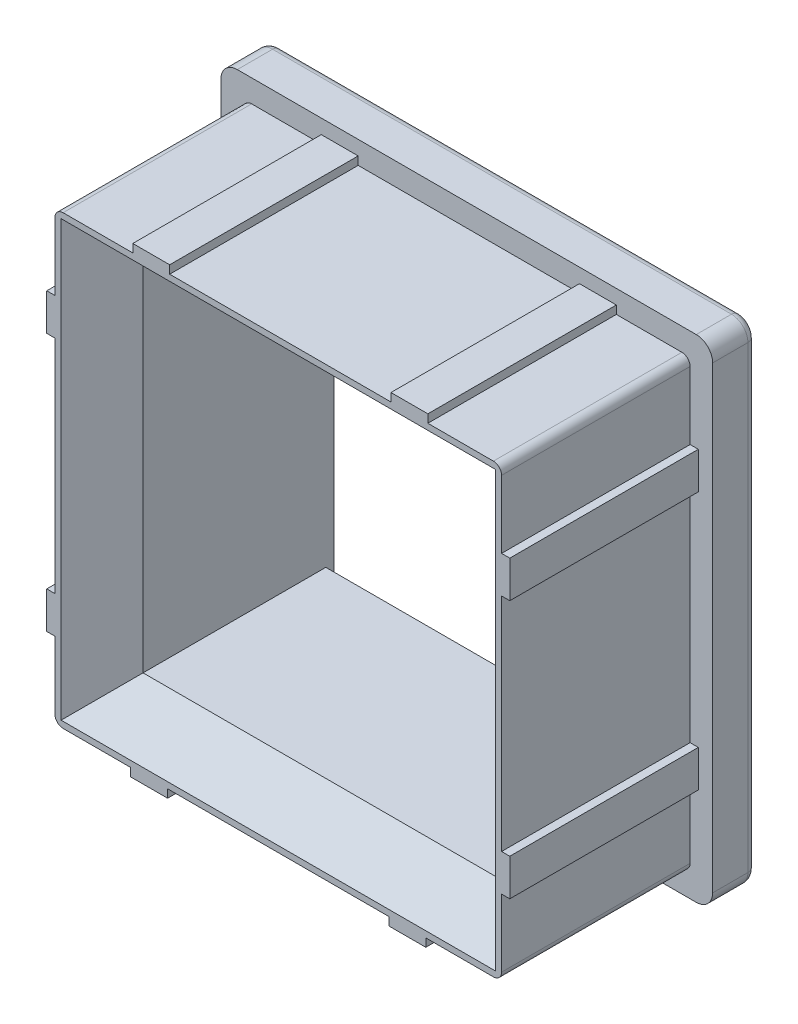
ISO-10303-21;
HEADER;
FILE_DESCRIPTION(('STEP AP214'),'2;1');
FILE_NAME('part.step','',(''),(''),'','','');
FILE_SCHEMA(('AUTOMOTIVE_DESIGN { 1 0 10303 214 1 1 1 1 }'));
ENDSEC;
DATA;
#1=APPLICATION_CONTEXT('core data for automotive mechanical design processes');
#2=APPLICATION_PROTOCOL_DEFINITION('international standard','automotive_design',2000,#1);
#3=PRODUCT_CONTEXT('',#1,'mechanical');
#4=PRODUCT('Part','Part','',(#3));
#5=PRODUCT_RELATED_PRODUCT_CATEGORY('part','',(#4));
#6=PRODUCT_DEFINITION_FORMATION('','',#4);
#7=PRODUCT_DEFINITION_CONTEXT('part definition',#1,'design');
#8=PRODUCT_DEFINITION('design','',#6,#7);
#9=PRODUCT_DEFINITION_SHAPE('','',#8);
#10=(LENGTH_UNIT() NAMED_UNIT(*) SI_UNIT(.MILLI.,.METRE.));
#11=(NAMED_UNIT(*) PLANE_ANGLE_UNIT() SI_UNIT($,.RADIAN.));
#12=(NAMED_UNIT(*) SI_UNIT($,.STERADIAN.) SOLID_ANGLE_UNIT());
#13=UNCERTAINTY_MEASURE_WITH_UNIT(LENGTH_MEASURE(1.E-05),#10,'distance_accuracy_value','');
#14=(GEOMETRIC_REPRESENTATION_CONTEXT(3) GLOBAL_UNCERTAINTY_ASSIGNED_CONTEXT((#13)) GLOBAL_UNIT_ASSIGNED_CONTEXT((#10,
#11,#12)) REPRESENTATION_CONTEXT('',''));
#15=CARTESIAN_POINT('',(0.,0.,0.));
#16=DIRECTION('',(0.,0.,1.));
#17=DIRECTION('',(1.,0.,0.));
#18=AXIS2_PLACEMENT_3D('',#15,#16,#17);
#19=CARTESIAN_POINT('',(0.,0.,5.3));
#20=DIRECTION('',(0.,0.,1.));
#21=DIRECTION('',(1.,0.,0.));
#22=AXIS2_PLACEMENT_3D('',#19,#20,#21);
#23=PLANE('',#22);
#24=DIRECTION('',(0.,-1.,0.));
#25=VECTOR('',#24,1.);
#26=CARTESIAN_POINT('',(0.,60.,5.3));
#27=LINE('',#26,#25);
#28=CARTESIAN_POINT('',(0.,58.,5.3));
#29=VERTEX_POINT('',#28);
#30=CARTESIAN_POINT('',(0.,2.,5.3));
#31=VERTEX_POINT('',#30);
#32=EDGE_CURVE('E434',#29,#31,#27,.T.);
#33=ORIENTED_EDGE('',*,*,#32,.T.);
#34=CARTESIAN_POINT('',(2.,2.,5.3));
#35=DIRECTION('',(0.,0.,1.));
#36=DIRECTION('',(1.,0.,0.));
#37=AXIS2_PLACEMENT_3D('',#34,#35,#36);
#38=CIRCLE('',#37,2.);
#39=CARTESIAN_POINT('',(2.,0.,5.3));
#40=VERTEX_POINT('',#39);
#41=EDGE_CURVE('E473',#31,#40,#38,.T.);
#42=ORIENTED_EDGE('',*,*,#41,.T.);
#43=DIRECTION('',(1.,0.,0.));
#44=VECTOR('',#43,1.);
#45=CARTESIAN_POINT('',(0.,0.,5.3));
#46=LINE('',#45,#44);
#47=CARTESIAN_POINT('',(58.,0.,5.3));
#48=VERTEX_POINT('',#47);
#49=EDGE_CURVE('E437',#40,#48,#46,.T.);
#50=ORIENTED_EDGE('',*,*,#49,.T.);
#51=CARTESIAN_POINT('',(58.,2.,5.3));
#52=DIRECTION('',(0.,0.,1.));
#53=DIRECTION('',(1.,0.,0.));
#54=AXIS2_PLACEMENT_3D('',#51,#52,#53);
#55=CIRCLE('',#54,2.);
#56=CARTESIAN_POINT('',(60.,2.,5.3));
#57=VERTEX_POINT('',#56);
#58=EDGE_CURVE('E460',#48,#57,#55,.T.);
#59=ORIENTED_EDGE('',*,*,#58,.T.);
#60=DIRECTION('',(0.,1.,0.));
#61=VECTOR('',#60,1.);
#62=CARTESIAN_POINT('',(60.,0.,5.3));
#63=LINE('',#62,#61);
#64=CARTESIAN_POINT('',(60.,58.,5.3));
#65=VERTEX_POINT('',#64);
#66=EDGE_CURVE('E445',#57,#65,#63,.T.);
#67=ORIENTED_EDGE('',*,*,#66,.T.);
#68=CARTESIAN_POINT('',(58.,58.,5.3));
#69=DIRECTION('',(0.,0.,1.));
#70=DIRECTION('',(1.,0.,0.));
#71=AXIS2_PLACEMENT_3D('',#68,#69,#70);
#72=CIRCLE('',#71,2.);
#73=CARTESIAN_POINT('',(58.,60.,5.3));
#74=VERTEX_POINT('',#73);
#75=EDGE_CURVE('E467',#65,#74,#72,.T.);
#76=ORIENTED_EDGE('',*,*,#75,.T.);
#77=DIRECTION('',(-1.,0.,0.));
#78=VECTOR('',#77,1.);
#79=CARTESIAN_POINT('',(60.,60.,5.3));
#80=LINE('',#79,#78);
#81=CARTESIAN_POINT('',(2.,60.,5.3));
#82=VERTEX_POINT('',#81);
#83=EDGE_CURVE('E448',#74,#82,#80,.T.);
#84=ORIENTED_EDGE('',*,*,#83,.T.);
#85=CARTESIAN_POINT('',(2.,58.,5.3));
#86=DIRECTION('',(0.,0.,1.));
#87=DIRECTION('',(1.,0.,0.));
#88=AXIS2_PLACEMENT_3D('',#85,#86,#87);
#89=CIRCLE('',#88,2.);
#90=EDGE_CURVE('E453',#82,#29,#89,.T.);
#91=ORIENTED_EDGE('',*,*,#90,.T.);
#92=EDGE_LOOP('',(#33,#42,#50,#59,#67,#76,#84,#91));
#93=FACE_BOUND('',#92,.T.);
#94=DIRECTION('',(-1.,0.,0.));
#95=VECTOR('',#94,1.);
#96=CARTESIAN_POINT('',(57.25,48.,5.3));
#97=LINE('',#96,#95);
#98=CARTESIAN_POINT('',(58.25,48.,5.3));
#99=VERTEX_POINT('',#98);
#100=CARTESIAN_POINT('',(57.25,48.,5.3));
#101=VERTEX_POINT('',#100);
#102=EDGE_CURVE('E841',#99,#101,#97,.T.);
#103=ORIENTED_EDGE('',*,*,#102,.F.);
#104=DIRECTION('',(0.,1.,0.));
#105=VECTOR('',#104,1.);
#106=CARTESIAN_POINT('',(58.25,48.,5.3));
#107=LINE('',#106,#105);
#108=CARTESIAN_POINT('',(58.25,43.5,5.3));
#109=VERTEX_POINT('',#108);
#110=EDGE_CURVE('E432',#109,#99,#107,.T.);
#111=ORIENTED_EDGE('',*,*,#110,.F.);
#112=DIRECTION('',(1.,0.,0.));
#113=VECTOR('',#112,1.);
#114=CARTESIAN_POINT('',(58.25,43.5,5.3));
#115=LINE('',#114,#113);
#116=CARTESIAN_POINT('',(57.25,43.5,5.3));
#117=VERTEX_POINT('',#116);
#118=EDGE_CURVE('E428',#117,#109,#115,.T.);
#119=ORIENTED_EDGE('',*,*,#118,.F.);
#120=DIRECTION('',(0.,1.,0.));
#121=VECTOR('',#120,1.);
#122=CARTESIAN_POINT('',(57.25,43.5,5.3));
#123=LINE('',#122,#121);
#124=CARTESIAN_POINT('',(57.25,16.5,5.3));
#125=VERTEX_POINT('',#124);
#126=EDGE_CURVE('E912',#125,#117,#123,.T.);
#127=ORIENTED_EDGE('',*,*,#126,.F.);
#128=DIRECTION('',(-1.,0.,0.));
#129=VECTOR('',#128,1.);
#130=CARTESIAN_POINT('',(57.25,16.5,5.3));
#131=LINE('',#130,#129);
#132=CARTESIAN_POINT('',(58.25,16.5,5.3));
#133=VERTEX_POINT('',#132);
#134=EDGE_CURVE('E910',#133,#125,#131,.T.);
#135=ORIENTED_EDGE('',*,*,#134,.F.);
#136=DIRECTION('',(0.,1.,0.));
#137=VECTOR('',#136,1.);
#138=CARTESIAN_POINT('',(58.25,16.5,5.3));
#139=LINE('',#138,#137);
#140=CARTESIAN_POINT('',(58.25,12.,5.3));
#141=VERTEX_POINT('',#140);
#142=EDGE_CURVE('E908',#141,#133,#139,.T.);
#143=ORIENTED_EDGE('',*,*,#142,.F.);
#144=DIRECTION('',(1.,0.,0.));
#145=VECTOR('',#144,1.);
#146=CARTESIAN_POINT('',(58.25,12.,5.3));
#147=LINE('',#146,#145);
#148=CARTESIAN_POINT('',(57.25,12.,5.3));
#149=VERTEX_POINT('',#148);
#150=EDGE_CURVE('E906',#149,#141,#147,.T.);
#151=ORIENTED_EDGE('',*,*,#150,.F.);
#152=DIRECTION('',(0.,1.,0.));
#153=VECTOR('',#152,1.);
#154=CARTESIAN_POINT('',(57.25,12.,5.3));
#155=LINE('',#154,#153);
#156=CARTESIAN_POINT('',(57.25,3.75,5.3));
#157=VERTEX_POINT('',#156);
#158=EDGE_CURVE('E904',#157,#149,#155,.T.);
#159=ORIENTED_EDGE('',*,*,#158,.F.);
#160=CARTESIAN_POINT('',(56.25,3.75,5.3));
#161=DIRECTION('',(0.,0.,1.));
#162=DIRECTION('',(1.,0.,0.));
#163=AXIS2_PLACEMENT_3D('',#160,#161,#162);
#164=CIRCLE('',#163,1.);
#165=CARTESIAN_POINT('',(56.25,2.75,5.3));
#166=VERTEX_POINT('',#165);
#167=EDGE_CURVE('E542',#157,#166,#164,.F.);
#168=ORIENTED_EDGE('',*,*,#167,.T.);
#169=DIRECTION('',(1.,0.,0.));
#170=VECTOR('',#169,1.);
#171=CARTESIAN_POINT('',(57.25,2.75,5.3));
#172=LINE('',#171,#170);
#173=CARTESIAN_POINT('',(48.,2.75,5.3));
#174=VERTEX_POINT('',#173);
#175=EDGE_CURVE('E901',#174,#166,#172,.T.);
#176=ORIENTED_EDGE('',*,*,#175,.F.);
#177=DIRECTION('',(0.,1.,0.));
#178=VECTOR('',#177,1.);
#179=CARTESIAN_POINT('',(48.,2.75,5.3));
#180=LINE('',#179,#178);
#181=CARTESIAN_POINT('',(48.,1.75,5.3));
#182=VERTEX_POINT('',#181);
#183=EDGE_CURVE('E899',#182,#174,#180,.T.);
#184=ORIENTED_EDGE('',*,*,#183,.F.);
#185=DIRECTION('',(1.,0.,0.));
#186=VECTOR('',#185,1.);
#187=CARTESIAN_POINT('',(48.,1.75,5.3));
#188=LINE('',#187,#186);
#189=CARTESIAN_POINT('',(43.5,1.75,5.3));
#190=VERTEX_POINT('',#189);
#191=EDGE_CURVE('E897',#190,#182,#188,.T.);
#192=ORIENTED_EDGE('',*,*,#191,.F.);
#193=DIRECTION('',(0.,-1.,0.));
#194=VECTOR('',#193,1.);
#195=CARTESIAN_POINT('',(43.5,1.75,5.3));
#196=LINE('',#195,#194);
#197=CARTESIAN_POINT('',(43.5,2.75,5.3));
#198=VERTEX_POINT('',#197);
#199=EDGE_CURVE('E895',#198,#190,#196,.T.);
#200=ORIENTED_EDGE('',*,*,#199,.F.);
#201=DIRECTION('',(1.,0.,0.));
#202=VECTOR('',#201,1.);
#203=CARTESIAN_POINT('',(43.5,2.75,5.3));
#204=LINE('',#203,#202);
#205=CARTESIAN_POINT('',(16.5,2.75,5.3));
#206=VERTEX_POINT('',#205);
#207=EDGE_CURVE('E893',#206,#198,#204,.T.);
#208=ORIENTED_EDGE('',*,*,#207,.F.);
#209=DIRECTION('',(0.,1.,0.));
#210=VECTOR('',#209,1.);
#211=CARTESIAN_POINT('',(16.5,2.75,5.3));
#212=LINE('',#211,#210);
#213=CARTESIAN_POINT('',(16.5,1.75,5.3));
#214=VERTEX_POINT('',#213);
#215=EDGE_CURVE('E891',#214,#206,#212,.T.);
#216=ORIENTED_EDGE('',*,*,#215,.F.);
#217=DIRECTION('',(1.,0.,0.));
#218=VECTOR('',#217,1.);
#219=CARTESIAN_POINT('',(16.5,1.75,5.3));
#220=LINE('',#219,#218);
#221=CARTESIAN_POINT('',(12.,1.75,5.3));
#222=VERTEX_POINT('',#221);
#223=EDGE_CURVE('E889',#222,#214,#220,.T.);
#224=ORIENTED_EDGE('',*,*,#223,.F.);
#225=DIRECTION('',(0.,-1.,0.));
#226=VECTOR('',#225,1.);
#227=CARTESIAN_POINT('',(12.,1.75,5.3));
#228=LINE('',#227,#226);
#229=CARTESIAN_POINT('',(12.,2.75,5.3));
#230=VERTEX_POINT('',#229);
#231=EDGE_CURVE('E887',#230,#222,#228,.T.);
#232=ORIENTED_EDGE('',*,*,#231,.F.);
#233=DIRECTION('',(1.,0.,0.));
#234=VECTOR('',#233,1.);
#235=CARTESIAN_POINT('',(12.,2.75,5.3));
#236=LINE('',#235,#234);
#237=CARTESIAN_POINT('',(3.75000000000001,2.75,5.3));
#238=VERTEX_POINT('',#237);
#239=EDGE_CURVE('E885',#238,#230,#236,.T.);
#240=ORIENTED_EDGE('',*,*,#239,.F.);
#241=CARTESIAN_POINT('',(3.75000000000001,3.75,5.3));
#242=DIRECTION('',(0.,0.,1.));
#243=DIRECTION('',(1.,0.,0.));
#244=AXIS2_PLACEMENT_3D('',#241,#242,#243);
#245=CIRCLE('',#244,1.);
#246=CARTESIAN_POINT('',(2.75000000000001,3.75,5.3));
#247=VERTEX_POINT('',#246);
#248=EDGE_CURVE('E560',#238,#247,#245,.F.);
#249=ORIENTED_EDGE('',*,*,#248,.T.);
#250=DIRECTION('',(0.,-1.,0.));
#251=VECTOR('',#250,1.);
#252=CARTESIAN_POINT('',(2.75000000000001,2.75,5.3));
#253=LINE('',#252,#251);
#254=CARTESIAN_POINT('',(2.75000000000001,12.,5.3));
#255=VERTEX_POINT('',#254);
#256=EDGE_CURVE('E882',#255,#247,#253,.T.);
#257=ORIENTED_EDGE('',*,*,#256,.F.);
#258=DIRECTION('',(1.,0.,0.));
#259=VECTOR('',#258,1.);
#260=CARTESIAN_POINT('',(2.75000000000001,12.,5.3));
#261=LINE('',#260,#259);
#262=CARTESIAN_POINT('',(1.75000000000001,12.,5.3));
#263=VERTEX_POINT('',#262);
#264=EDGE_CURVE('E880',#263,#255,#261,.T.);
#265=ORIENTED_EDGE('',*,*,#264,.F.);
#266=DIRECTION('',(0.,-1.,0.));
#267=VECTOR('',#266,1.);
#268=CARTESIAN_POINT('',(1.75000000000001,12.,5.3));
#269=LINE('',#268,#267);
#270=CARTESIAN_POINT('',(1.75000000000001,16.5,5.3));
#271=VERTEX_POINT('',#270);
#272=EDGE_CURVE('E878',#271,#263,#269,.T.);
#273=ORIENTED_EDGE('',*,*,#272,.F.);
#274=DIRECTION('',(-1.,0.,0.));
#275=VECTOR('',#274,1.);
#276=CARTESIAN_POINT('',(1.75000000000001,16.5,5.3));
#277=LINE('',#276,#275);
#278=CARTESIAN_POINT('',(2.75,16.5,5.3));
#279=VERTEX_POINT('',#278);
#280=EDGE_CURVE('E876',#279,#271,#277,.T.);
#281=ORIENTED_EDGE('',*,*,#280,.F.);
#282=DIRECTION('',(0.,-1.,0.));
#283=VECTOR('',#282,1.);
#284=CARTESIAN_POINT('',(2.75,16.5,5.3));
#285=LINE('',#284,#283);
#286=CARTESIAN_POINT('',(2.75,43.5,5.3));
#287=VERTEX_POINT('',#286);
#288=EDGE_CURVE('E874',#287,#279,#285,.T.);
#289=ORIENTED_EDGE('',*,*,#288,.F.);
#290=DIRECTION('',(1.,0.,0.));
#291=VECTOR('',#290,1.);
#292=CARTESIAN_POINT('',(2.75,43.5,5.3));
#293=LINE('',#292,#291);
#294=CARTESIAN_POINT('',(1.75,43.5,5.3));
#295=VERTEX_POINT('',#294);
#296=EDGE_CURVE('E872',#295,#287,#293,.T.);
#297=ORIENTED_EDGE('',*,*,#296,.F.);
#298=DIRECTION('',(0.,-1.,0.));
#299=VECTOR('',#298,1.);
#300=CARTESIAN_POINT('',(1.75,43.5,5.3));
#301=LINE('',#300,#299);
#302=CARTESIAN_POINT('',(1.75,48.,5.3));
#303=VERTEX_POINT('',#302);
#304=EDGE_CURVE('E870',#303,#295,#301,.T.);
#305=ORIENTED_EDGE('',*,*,#304,.F.);
#306=DIRECTION('',(-1.,0.,0.));
#307=VECTOR('',#306,1.);
#308=CARTESIAN_POINT('',(1.75,48.,5.3));
#309=LINE('',#308,#307);
#310=CARTESIAN_POINT('',(2.75,48.,5.3));
#311=VERTEX_POINT('',#310);
#312=EDGE_CURVE('E868',#311,#303,#309,.T.);
#313=ORIENTED_EDGE('',*,*,#312,.F.);
#314=DIRECTION('',(0.,-1.,0.));
#315=VECTOR('',#314,1.);
#316=CARTESIAN_POINT('',(2.75,48.,5.3));
#317=LINE('',#316,#315);
#318=CARTESIAN_POINT('',(2.75,56.25,5.3));
#319=VERTEX_POINT('',#318);
#320=EDGE_CURVE('E866',#319,#311,#317,.T.);
#321=ORIENTED_EDGE('',*,*,#320,.F.);
#322=CARTESIAN_POINT('',(3.75,56.25,5.3));
#323=DIRECTION('',(0.,0.,1.));
#324=DIRECTION('',(1.,0.,0.));
#325=AXIS2_PLACEMENT_3D('',#322,#323,#324);
#326=CIRCLE('',#325,1.);
#327=CARTESIAN_POINT('',(3.75,57.25,5.3));
#328=VERTEX_POINT('',#327);
#329=EDGE_CURVE('E551',#319,#328,#326,.F.);
#330=ORIENTED_EDGE('',*,*,#329,.T.);
#331=DIRECTION('',(-1.,0.,0.));
#332=VECTOR('',#331,1.);
#333=CARTESIAN_POINT('',(2.75,57.25,5.3));
#334=LINE('',#333,#332);
#335=CARTESIAN_POINT('',(12.25,57.25,5.3));
#336=VERTEX_POINT('',#335);
#337=EDGE_CURVE('E863',#336,#328,#334,.T.);
#338=ORIENTED_EDGE('',*,*,#337,.F.);
#339=DIRECTION('',(0.,-1.,0.));
#340=VECTOR('',#339,1.);
#341=CARTESIAN_POINT('',(12.25,57.25,5.3));
#342=LINE('',#341,#340);
#343=CARTESIAN_POINT('',(12.25,58.25,5.3));
#344=VERTEX_POINT('',#343);
#345=EDGE_CURVE('E861',#344,#336,#342,.T.);
#346=ORIENTED_EDGE('',*,*,#345,.F.);
#347=DIRECTION('',(-1.,0.,0.));
#348=VECTOR('',#347,1.);
#349=CARTESIAN_POINT('',(12.25,58.25,5.3));
#350=LINE('',#349,#348);
#351=CARTESIAN_POINT('',(16.75,58.25,5.3));
#352=VERTEX_POINT('',#351);
#353=EDGE_CURVE('E859',#352,#344,#350,.T.);
#354=ORIENTED_EDGE('',*,*,#353,.F.);
#355=DIRECTION('',(0.,1.,0.));
#356=VECTOR('',#355,1.);
#357=CARTESIAN_POINT('',(16.75,58.25,5.3));
#358=LINE('',#357,#356);
#359=CARTESIAN_POINT('',(16.75,57.25,5.3));
#360=VERTEX_POINT('',#359);
#361=EDGE_CURVE('E857',#360,#352,#358,.T.);
#362=ORIENTED_EDGE('',*,*,#361,.F.);
#363=DIRECTION('',(-1.,0.,0.));
#364=VECTOR('',#363,1.);
#365=CARTESIAN_POINT('',(16.75,57.25,5.3));
#366=LINE('',#365,#364);
#367=CARTESIAN_POINT('',(43.75,57.25,5.3));
#368=VERTEX_POINT('',#367);
#369=EDGE_CURVE('E855',#368,#360,#366,.T.);
#370=ORIENTED_EDGE('',*,*,#369,.F.);
#371=DIRECTION('',(0.,-1.,0.));
#372=VECTOR('',#371,1.);
#373=CARTESIAN_POINT('',(43.75,57.25,5.3));
#374=LINE('',#373,#372);
#375=CARTESIAN_POINT('',(43.75,58.25,5.3));
#376=VERTEX_POINT('',#375);
#377=EDGE_CURVE('E853',#376,#368,#374,.T.);
#378=ORIENTED_EDGE('',*,*,#377,.F.);
#379=DIRECTION('',(-1.,0.,0.));
#380=VECTOR('',#379,1.);
#381=CARTESIAN_POINT('',(43.75,58.25,5.3));
#382=LINE('',#381,#380);
#383=CARTESIAN_POINT('',(48.25,58.25,5.3));
#384=VERTEX_POINT('',#383);
#385=EDGE_CURVE('E851',#384,#376,#382,.T.);
#386=ORIENTED_EDGE('',*,*,#385,.F.);
#387=DIRECTION('',(0.,1.,0.));
#388=VECTOR('',#387,1.);
#389=CARTESIAN_POINT('',(48.25,58.25,5.3));
#390=LINE('',#389,#388);
#391=CARTESIAN_POINT('',(48.25,57.25,5.3));
#392=VERTEX_POINT('',#391);
#393=EDGE_CURVE('E849',#392,#384,#390,.T.);
#394=ORIENTED_EDGE('',*,*,#393,.F.);
#395=DIRECTION('',(-1.,0.,0.));
#396=VECTOR('',#395,1.);
#397=CARTESIAN_POINT('',(48.25,57.25,5.3));
#398=LINE('',#397,#396);
#399=CARTESIAN_POINT('',(56.25,57.25,5.3));
#400=VERTEX_POINT('',#399);
#401=EDGE_CURVE('E847',#400,#392,#398,.T.);
#402=ORIENTED_EDGE('',*,*,#401,.F.);
#403=CARTESIAN_POINT('',(56.25,56.25,5.3));
#404=DIRECTION('',(0.,0.,1.));
#405=DIRECTION('',(1.,0.,0.));
#406=AXIS2_PLACEMENT_3D('',#403,#404,#405);
#407=CIRCLE('',#406,1.);
#408=CARTESIAN_POINT('',(57.25,56.25,5.3));
#409=VERTEX_POINT('',#408);
#410=EDGE_CURVE('E569',#400,#409,#407,.F.);
#411=ORIENTED_EDGE('',*,*,#410,.T.);
#412=DIRECTION('',(0.,1.,0.));
#413=VECTOR('',#412,1.);
#414=CARTESIAN_POINT('',(57.25,57.25,5.3));
#415=LINE('',#414,#413);
#416=EDGE_CURVE('E844',#101,#409,#415,.T.);
#417=ORIENTED_EDGE('',*,*,#416,.F.);
#418=EDGE_LOOP('',(#103,#111,#119,#127,#135,#143,#151,#159,#168,#176,#184,#192,#200,#208,#216,
#224,#232,#240,#249,#257,#265,#273,#281,#289,#297,#305,#313,#321,#330,#338,#346,#354,#362,#370,
#378,#386,#394,#402,#411,#417));
#419=FACE_BOUND('',#418,.T.);
#420=ADVANCED_FACE('F30',(#93,#419),#23,.T.);
#421=CARTESIAN_POINT('',(0.,60.,0.));
#422=DIRECTION('',(-1.,0.,0.));
#423=DIRECTION('',(0.,0.,1.));
#424=AXIS2_PLACEMENT_3D('',#421,#422,#423);
#425=PLANE('',#424);
#426=DIRECTION('',(0.,0.,1.));
#427=VECTOR('',#426,1.);
#428=CARTESIAN_POINT('',(0.,58.,0.));
#429=LINE('',#428,#427);
#430=CARTESIAN_POINT('',(0.,58.,1.));
#431=VERTEX_POINT('',#430);
#432=EDGE_CURVE('E455',#29,#431,#429,.F.);
#433=ORIENTED_EDGE('',*,*,#432,.T.);
#434=DIRECTION('',(0.,-1.,0.));
#435=VECTOR('',#434,1.);
#436=CARTESIAN_POINT('',(0.,2.,1.));
#437=LINE('',#436,#435);
#438=CARTESIAN_POINT('',(0.,2.,1.));
#439=VERTEX_POINT('',#438);
#440=EDGE_CURVE('E595',#431,#439,#437,.T.);
#441=ORIENTED_EDGE('',*,*,#440,.T.);
#442=DIRECTION('',(0.,0.,1.));
#443=VECTOR('',#442,1.);
#444=CARTESIAN_POINT('',(0.,2.,0.));
#445=LINE('',#444,#443);
#446=EDGE_CURVE('E471',#439,#31,#445,.T.);
#447=ORIENTED_EDGE('',*,*,#446,.T.);
#448=ORIENTED_EDGE('',*,*,#32,.F.);
#449=EDGE_LOOP('',(#433,#441,#447,#448));
#450=FACE_BOUND('',#449,.T.);
#451=ADVANCED_FACE('F685',(#450),#425,.T.);
#452=CARTESIAN_POINT('',(60.,60.,0.));
#453=DIRECTION('',(0.,1.,0.));
#454=DIRECTION('',(0.,0.,1.));
#455=AXIS2_PLACEMENT_3D('',#452,#453,#454);
#456=PLANE('',#455);
#457=DIRECTION('',(0.,0.,1.));
#458=VECTOR('',#457,1.);
#459=CARTESIAN_POINT('',(58.,60.,0.));
#460=LINE('',#459,#458);
#461=CARTESIAN_POINT('',(58.,60.,1.));
#462=VERTEX_POINT('',#461);
#463=EDGE_CURVE('E469',#74,#462,#460,.F.);
#464=ORIENTED_EDGE('',*,*,#463,.T.);
#465=DIRECTION('',(-1.,0.,0.));
#466=VECTOR('',#465,1.);
#467=CARTESIAN_POINT('',(2.,60.,1.));
#468=LINE('',#467,#466);
#469=CARTESIAN_POINT('',(2.,60.,1.));
#470=VERTEX_POINT('',#469);
#471=EDGE_CURVE('E11',#462,#470,#468,.T.);
#472=ORIENTED_EDGE('',*,*,#471,.T.);
#473=DIRECTION('',(0.,0.,1.));
#474=VECTOR('',#473,1.);
#475=CARTESIAN_POINT('',(2.,60.,0.));
#476=LINE('',#475,#474);
#477=EDGE_CURVE('E451',#470,#82,#476,.T.);
#478=ORIENTED_EDGE('',*,*,#477,.T.);
#479=ORIENTED_EDGE('',*,*,#83,.F.);
#480=EDGE_LOOP('',(#464,#472,#478,#479));
#481=FACE_BOUND('',#480,.T.);
#482=ADVANCED_FACE('F690',(#481),#456,.T.);
#483=CARTESIAN_POINT('',(60.,0.,0.));
#484=DIRECTION('',(1.,0.,0.));
#485=DIRECTION('',(0.,1.,0.));
#486=AXIS2_PLACEMENT_3D('',#483,#484,#485);
#487=PLANE('',#486);
#488=DIRECTION('',(0.,0.,1.));
#489=VECTOR('',#488,1.);
#490=CARTESIAN_POINT('',(60.,2.,0.));
#491=LINE('',#490,#489);
#492=CARTESIAN_POINT('',(60.,2.,1.));
#493=VERTEX_POINT('',#492);
#494=EDGE_CURVE('E462',#57,#493,#491,.F.);
#495=ORIENTED_EDGE('',*,*,#494,.T.);
#496=DIRECTION('',(0.,1.,0.));
#497=VECTOR('',#496,1.);
#498=CARTESIAN_POINT('',(60.,58.,1.));
#499=LINE('',#498,#497);
#500=CARTESIAN_POINT('',(60.,58.,1.));
#501=VERTEX_POINT('',#500);
#502=EDGE_CURVE('E597',#493,#501,#499,.T.);
#503=ORIENTED_EDGE('',*,*,#502,.T.);
#504=DIRECTION('',(0.,0.,1.));
#505=VECTOR('',#504,1.);
#506=CARTESIAN_POINT('',(60.,58.,0.));
#507=LINE('',#506,#505);
#508=EDGE_CURVE('E465',#501,#65,#507,.T.);
#509=ORIENTED_EDGE('',*,*,#508,.T.);
#510=ORIENTED_EDGE('',*,*,#66,.F.);
#511=EDGE_LOOP('',(#495,#503,#509,#510));
#512=FACE_BOUND('',#511,.T.);
#513=ADVANCED_FACE('F665',(#512),#487,.T.);
#514=CARTESIAN_POINT('',(0.,0.,0.));
#515=DIRECTION('',(0.,-1.,0.));
#516=DIRECTION('',(1.,0.,0.));
#517=AXIS2_PLACEMENT_3D('',#514,#515,#516);
#518=PLANE('',#517);
#519=DIRECTION('',(0.,0.,1.));
#520=VECTOR('',#519,1.);
#521=CARTESIAN_POINT('',(2.,0.,0.));
#522=LINE('',#521,#520);
#523=CARTESIAN_POINT('',(2.,0.,1.));
#524=VERTEX_POINT('',#523);
#525=EDGE_CURVE('E475',#40,#524,#522,.F.);
#526=ORIENTED_EDGE('',*,*,#525,.T.);
#527=DIRECTION('',(1.,0.,0.));
#528=VECTOR('',#527,1.);
#529=CARTESIAN_POINT('',(58.,0.,1.));
#530=LINE('',#529,#528);
#531=CARTESIAN_POINT('',(58.,0.,1.));
#532=VERTEX_POINT('',#531);
#533=EDGE_CURVE('E571',#524,#532,#530,.T.);
#534=ORIENTED_EDGE('',*,*,#533,.T.);
#535=DIRECTION('',(0.,0.,1.));
#536=VECTOR('',#535,1.);
#537=CARTESIAN_POINT('',(58.,0.,0.));
#538=LINE('',#537,#536);
#539=EDGE_CURVE('E458',#532,#48,#538,.T.);
#540=ORIENTED_EDGE('',*,*,#539,.T.);
#541=ORIENTED_EDGE('',*,*,#49,.F.);
#542=EDGE_LOOP('',(#526,#534,#540,#541));
#543=FACE_BOUND('',#542,.T.);
#544=ADVANCED_FACE('F653',(#543),#518,.T.);
#545=CARTESIAN_POINT('',(0.,0.,0.));
#546=DIRECTION('',(0.,0.,1.));
#547=DIRECTION('',(1.,0.,0.));
#548=AXIS2_PLACEMENT_3D('',#545,#546,#547);
#549=PLANE('',#548);
#550=CARTESIAN_POINT('',(58.,2.,0.));
#551=DIRECTION('',(0.,0.,1.));
#552=DIRECTION('',(1.,0.,0.));
#553=AXIS2_PLACEMENT_3D('',#550,#551,#552);
#554=CIRCLE('',#553,1.);
#555=CARTESIAN_POINT('',(59.,2.,0.));
#556=VERTEX_POINT('',#555);
#557=CARTESIAN_POINT('',(58.,1.,0.));
#558=VERTEX_POINT('',#557);
#559=EDGE_CURVE('E584',#556,#558,#554,.F.);
#560=ORIENTED_EDGE('',*,*,#559,.T.);
#561=DIRECTION('',(1.,0.,0.));
#562=VECTOR('',#561,1.);
#563=CARTESIAN_POINT('',(2.,1.,0.));
#564=LINE('',#563,#562);
#565=CARTESIAN_POINT('',(2.,1.,0.));
#566=VERTEX_POINT('',#565);
#567=EDGE_CURVE('E588',#558,#566,#564,.F.);
#568=ORIENTED_EDGE('',*,*,#567,.T.);
#569=CARTESIAN_POINT('',(2.,2.,0.));
#570=DIRECTION('',(0.,0.,1.));
#571=DIRECTION('',(1.,0.,0.));
#572=AXIS2_PLACEMENT_3D('',#569,#570,#571);
#573=CIRCLE('',#572,1.);
#574=CARTESIAN_POINT('',(1.,2.,0.));
#575=VERTEX_POINT('',#574);
#576=EDGE_CURVE('E586',#566,#575,#573,.F.);
#577=ORIENTED_EDGE('',*,*,#576,.T.);
#578=DIRECTION('',(0.,-1.,0.));
#579=VECTOR('',#578,1.);
#580=CARTESIAN_POINT('',(1.,58.,0.));
#581=LINE('',#580,#579);
#582=CARTESIAN_POINT('',(1.,58.,0.));
#583=VERTEX_POINT('',#582);
#584=EDGE_CURVE('E582',#575,#583,#581,.F.);
#585=ORIENTED_EDGE('',*,*,#584,.T.);
#586=CARTESIAN_POINT('',(2.,58.,0.));
#587=DIRECTION('',(0.,0.,1.));
#588=DIRECTION('',(1.,0.,0.));
#589=AXIS2_PLACEMENT_3D('',#586,#587,#588);
#590=CIRCLE('',#589,1.);
#591=CARTESIAN_POINT('',(2.,59.,0.));
#592=VERTEX_POINT('',#591);
#593=EDGE_CURVE('E578',#583,#592,#590,.F.);
#594=ORIENTED_EDGE('',*,*,#593,.T.);
#595=DIRECTION('',(-1.,0.,0.));
#596=VECTOR('',#595,1.);
#597=CARTESIAN_POINT('',(58.,59.,0.));
#598=LINE('',#597,#596);
#599=CARTESIAN_POINT('',(58.,59.,0.));
#600=VERTEX_POINT('',#599);
#601=EDGE_CURVE('E574',#592,#600,#598,.F.);
#602=ORIENTED_EDGE('',*,*,#601,.T.);
#603=CARTESIAN_POINT('',(58.,58.,0.));
#604=DIRECTION('',(0.,0.,1.));
#605=DIRECTION('',(1.,0.,0.));
#606=AXIS2_PLACEMENT_3D('',#603,#604,#605);
#607=CIRCLE('',#606,1.);
#608=CARTESIAN_POINT('',(59.,58.,0.));
#609=VERTEX_POINT('',#608);
#610=EDGE_CURVE('E576',#600,#609,#607,.F.);
#611=ORIENTED_EDGE('',*,*,#610,.T.);
#612=DIRECTION('',(0.,1.,0.));
#613=VECTOR('',#612,1.);
#614=CARTESIAN_POINT('',(59.,2.,0.));
#615=LINE('',#614,#613);
#616=EDGE_CURVE('E580',#609,#556,#615,.F.);
#617=ORIENTED_EDGE('',*,*,#616,.T.);
#618=EDGE_LOOP('',(#560,#568,#577,#585,#594,#602,#611,#617));
#619=FACE_BOUND('',#618,.T.);
#620=DIRECTION('',(0.,1.,0.));
#621=VECTOR('',#620,1.);
#622=CARTESIAN_POINT('',(8.50000000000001,8.50000000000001,0.));
#623=LINE('',#622,#621);
#624=CARTESIAN_POINT('',(8.50000000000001,7.50000000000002,0.));
#625=VERTEX_POINT('',#624);
#626=CARTESIAN_POINT('',(8.5,52.5,0.));
#627=VERTEX_POINT('',#626);
#628=EDGE_CURVE('E508',#625,#627,#623,.T.);
#629=ORIENTED_EDGE('',*,*,#628,.F.);
#630=DIRECTION('',(1.,0.,0.));
#631=VECTOR('',#630,1.);
#632=CARTESIAN_POINT('',(0.,7.50000000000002,0.));
#633=LINE('',#632,#631);
#634=CARTESIAN_POINT('',(52.5,7.50000000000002,0.));
#635=VERTEX_POINT('',#634);
#636=EDGE_CURVE('E486',#625,#635,#633,.T.);
#637=ORIENTED_EDGE('',*,*,#636,.T.);
#638=DIRECTION('',(0.,1.,0.));
#639=VECTOR('',#638,1.);
#640=CARTESIAN_POINT('',(52.5,0.,0.));
#641=LINE('',#640,#639);
#642=CARTESIAN_POINT('',(52.5,52.5,0.));
#643=VERTEX_POINT('',#642);
#644=EDGE_CURVE('E484',#635,#643,#641,.T.);
#645=ORIENTED_EDGE('',*,*,#644,.T.);
#646=DIRECTION('',(-1.,0.,0.));
#647=VECTOR('',#646,1.);
#648=CARTESIAN_POINT('',(0.,52.5,0.));
#649=LINE('',#648,#647);
#650=EDGE_CURVE('E481',#643,#627,#649,.T.);
#651=ORIENTED_EDGE('',*,*,#650,.T.);
#652=EDGE_LOOP('',(#629,#637,#645,#651));
#653=FACE_BOUND('',#652,.T.);
#654=ADVANCED_FACE('F632',(#619,#653),#549,.F.);
#655=CARTESIAN_POINT('',(58.25,48.,28.3));
#656=DIRECTION('',(-1.,0.,0.));
#657=DIRECTION('',(0.,0.,1.));
#658=AXIS2_PLACEMENT_3D('',#655,#656,#657);
#659=PLANE('',#658);
#660=ORIENTED_EDGE('',*,*,#110,.T.);
#661=DIRECTION('',(0.,0.,-1.));
#662=VECTOR('',#661,1.);
#663=CARTESIAN_POINT('',(58.25,48.,28.3));
#664=LINE('',#663,#662);
#665=CARTESIAN_POINT('',(58.25,48.,28.3));
#666=VERTEX_POINT('',#665);
#667=EDGE_CURVE('E411',#666,#99,#664,.T.);
#668=ORIENTED_EDGE('',*,*,#667,.F.);
#669=DIRECTION('',(0.,1.,0.));
#670=VECTOR('',#669,1.);
#671=CARTESIAN_POINT('',(58.25,48.,28.3));
#672=LINE('',#671,#670);
#673=CARTESIAN_POINT('',(58.25,43.5,28.3));
#674=VERTEX_POINT('',#673);
#675=EDGE_CURVE('E419',#674,#666,#672,.T.);
#676=ORIENTED_EDGE('',*,*,#675,.F.);
#677=DIRECTION('',(0.,0.,-1.));
#678=VECTOR('',#677,1.);
#679=CARTESIAN_POINT('',(58.25,43.5,28.3));
#680=LINE('',#679,#678);
#681=EDGE_CURVE('E839',#674,#109,#680,.T.);
#682=ORIENTED_EDGE('',*,*,#681,.T.);
#683=EDGE_LOOP('',(#660,#668,#676,#682));
#684=FACE_BOUND('',#683,.T.);
#685=ADVANCED_FACE('F430',(#684),#659,.F.);
#686=CARTESIAN_POINT('',(57.25,48.,28.3));
#687=DIRECTION('',(0.,-1.,0.));
#688=DIRECTION('',(0.,0.,-1.));
#689=AXIS2_PLACEMENT_3D('',#686,#687,#688);
#690=PLANE('',#689);
#691=ORIENTED_EDGE('',*,*,#102,.T.);
#692=DIRECTION('',(0.,0.,-1.));
#693=VECTOR('',#692,1.);
#694=CARTESIAN_POINT('',(57.25,48.,28.3));
#695=LINE('',#694,#693);
#696=CARTESIAN_POINT('',(57.25,48.,28.3));
#697=VERTEX_POINT('',#696);
#698=EDGE_CURVE('E414',#697,#101,#695,.T.);
#699=ORIENTED_EDGE('',*,*,#698,.F.);
#700=DIRECTION('',(-1.,0.,0.));
#701=VECTOR('',#700,1.);
#702=CARTESIAN_POINT('',(57.25,48.,28.3));
#703=LINE('',#702,#701);
#704=EDGE_CURVE('E407',#666,#697,#703,.T.);
#705=ORIENTED_EDGE('',*,*,#704,.F.);
#706=ORIENTED_EDGE('',*,*,#667,.T.);
#707=EDGE_LOOP('',(#691,#699,#705,#706));
#708=FACE_BOUND('',#707,.T.);
#709=ADVANCED_FACE('F409',(#708),#690,.F.);
#710=CARTESIAN_POINT('',(57.25,57.25,28.3));
#711=DIRECTION('',(-1.,0.,0.));
#712=DIRECTION('',(0.,0.,1.));
#713=AXIS2_PLACEMENT_3D('',#710,#711,#712);
#714=PLANE('',#713);
#715=ORIENTED_EDGE('',*,*,#416,.T.);
#716=DIRECTION('',(0.,0.,-1.));
#717=VECTOR('',#716,1.);
#718=CARTESIAN_POINT('',(57.25,56.25,28.3));
#719=LINE('',#718,#717);
#720=CARTESIAN_POINT('',(57.25,56.25,28.3));
#721=VERTEX_POINT('',#720);
#722=EDGE_CURVE('E565',#409,#721,#719,.F.);
#723=ORIENTED_EDGE('',*,*,#722,.T.);
#724=DIRECTION('',(0.,1.,0.));
#725=VECTOR('',#724,1.);
#726=CARTESIAN_POINT('',(57.25,57.25,28.3));
#727=LINE('',#726,#725);
#728=EDGE_CURVE('E418',#697,#721,#727,.T.);
#729=ORIENTED_EDGE('',*,*,#728,.F.);
#730=ORIENTED_EDGE('',*,*,#698,.T.);
#731=EDGE_LOOP('',(#715,#723,#729,#730));
#732=FACE_BOUND('',#731,.T.);
#733=ADVANCED_FACE('F1163',(#732),#714,.F.);
#734=CARTESIAN_POINT('',(48.25,57.25,28.3));
#735=DIRECTION('',(0.,-1.,0.));
#736=DIRECTION('',(0.,0.,-1.));
#737=AXIS2_PLACEMENT_3D('',#734,#735,#736);
#738=PLANE('',#737);
#739=DIRECTION('',(-1.,0.,0.));
#740=VECTOR('',#739,1.);
#741=CARTESIAN_POINT('',(48.25,57.25,28.3));
#742=LINE('',#741,#740);
#743=CARTESIAN_POINT('',(56.25,57.25,28.3));
#744=VERTEX_POINT('',#743);
#745=CARTESIAN_POINT('',(48.25,57.25,28.3));
#746=VERTEX_POINT('',#745);
#747=EDGE_CURVE('E763',#744,#746,#742,.T.);
#748=ORIENTED_EDGE('',*,*,#747,.F.);
#749=DIRECTION('',(0.,0.,-1.));
#750=VECTOR('',#749,1.);
#751=CARTESIAN_POINT('',(56.25,57.25,28.3));
#752=LINE('',#751,#750);
#753=EDGE_CURVE('E562',#744,#400,#752,.T.);
#754=ORIENTED_EDGE('',*,*,#753,.T.);
#755=ORIENTED_EDGE('',*,*,#401,.T.);
#756=DIRECTION('',(0.,0.,-1.));
#757=VECTOR('',#756,1.);
#758=CARTESIAN_POINT('',(48.25,57.25,28.3));
#759=LINE('',#758,#757);
#760=EDGE_CURVE('E439',#746,#392,#759,.T.);
#761=ORIENTED_EDGE('',*,*,#760,.F.);
#762=EDGE_LOOP('',(#748,#754,#755,#761));
#763=FACE_BOUND('',#762,.T.);
#764=ADVANCED_FACE('F766',(#763),#738,.F.);
#765=CARTESIAN_POINT('',(48.25,58.25,28.3));
#766=DIRECTION('',(-1.,0.,0.));
#767=DIRECTION('',(0.,0.,1.));
#768=AXIS2_PLACEMENT_3D('',#765,#766,#767);
#769=PLANE('',#768);
#770=ORIENTED_EDGE('',*,*,#393,.T.);
#771=DIRECTION('',(0.,0.,-1.));
#772=VECTOR('',#771,1.);
#773=CARTESIAN_POINT('',(48.25,58.25,28.3));
#774=LINE('',#773,#772);
#775=CARTESIAN_POINT('',(48.25,58.25,28.3));
#776=VERTEX_POINT('',#775);
#777=EDGE_CURVE('E997',#776,#384,#774,.T.);
#778=ORIENTED_EDGE('',*,*,#777,.F.);
#779=DIRECTION('',(0.,1.,0.));
#780=VECTOR('',#779,1.);
#781=CARTESIAN_POINT('',(48.25,58.25,28.3));
#782=LINE('',#781,#780);
#783=EDGE_CURVE('E770',#746,#776,#782,.T.);
#784=ORIENTED_EDGE('',*,*,#783,.F.);
#785=ORIENTED_EDGE('',*,*,#760,.T.);
#786=EDGE_LOOP('',(#770,#778,#784,#785));
#787=FACE_BOUND('',#786,.T.);
#788=ADVANCED_FACE('F1001',(#787),#769,.F.);
#789=CARTESIAN_POINT('',(43.75,58.25,28.3));
#790=DIRECTION('',(0.,-1.,0.));
#791=DIRECTION('',(0.,0.,-1.));
#792=AXIS2_PLACEMENT_3D('',#789,#790,#791);
#793=PLANE('',#792);
#794=ORIENTED_EDGE('',*,*,#385,.T.);
#795=DIRECTION('',(0.,0.,-1.));
#796=VECTOR('',#795,1.);
#797=CARTESIAN_POINT('',(43.75,58.25,28.3));
#798=LINE('',#797,#796);
#799=CARTESIAN_POINT('',(43.75,58.25,28.3));
#800=VERTEX_POINT('',#799);
#801=EDGE_CURVE('E994',#800,#376,#798,.T.);
#802=ORIENTED_EDGE('',*,*,#801,.F.);
#803=DIRECTION('',(-1.,0.,0.));
#804=VECTOR('',#803,1.);
#805=CARTESIAN_POINT('',(43.75,58.25,28.3));
#806=LINE('',#805,#804);
#807=EDGE_CURVE('E772',#776,#800,#806,.T.);
#808=ORIENTED_EDGE('',*,*,#807,.F.);
#809=ORIENTED_EDGE('',*,*,#777,.T.);
#810=EDGE_LOOP('',(#794,#802,#808,#809));
#811=FACE_BOUND('',#810,.T.);
#812=ADVANCED_FACE('F1008',(#811),#793,.F.);
#813=CARTESIAN_POINT('',(43.75,57.25,28.3));
#814=DIRECTION('',(1.,0.,0.));
#815=DIRECTION('',(0.,0.,-1.));
#816=AXIS2_PLACEMENT_3D('',#813,#814,#815);
#817=PLANE('',#816);
#818=ORIENTED_EDGE('',*,*,#377,.T.);
#819=DIRECTION('',(0.,0.,-1.));
#820=VECTOR('',#819,1.);
#821=CARTESIAN_POINT('',(43.75,57.25,28.3));
#822=LINE('',#821,#820);
#823=CARTESIAN_POINT('',(43.75,57.25,28.3));
#824=VERTEX_POINT('',#823);
#825=EDGE_CURVE('E991',#824,#368,#822,.T.);
#826=ORIENTED_EDGE('',*,*,#825,.F.);
#827=DIRECTION('',(0.,-1.,0.));
#828=VECTOR('',#827,1.);
#829=CARTESIAN_POINT('',(43.75,57.25,28.3));
#830=LINE('',#829,#828);
#831=EDGE_CURVE('E777',#800,#824,#830,.T.);
#832=ORIENTED_EDGE('',*,*,#831,.F.);
#833=ORIENTED_EDGE('',*,*,#801,.T.);
#834=EDGE_LOOP('',(#818,#826,#832,#833));
#835=FACE_BOUND('',#834,.T.);
#836=ADVANCED_FACE('F1012',(#835),#817,.F.);
#837=CARTESIAN_POINT('',(16.75,57.25,28.3));
#838=DIRECTION('',(0.,-1.,0.));
#839=DIRECTION('',(0.,0.,-1.));
#840=AXIS2_PLACEMENT_3D('',#837,#838,#839);
#841=PLANE('',#840);
#842=ORIENTED_EDGE('',*,*,#369,.T.);
#843=DIRECTION('',(0.,0.,-1.));
#844=VECTOR('',#843,1.);
#845=CARTESIAN_POINT('',(16.75,57.25,28.3));
#846=LINE('',#845,#844);
#847=CARTESIAN_POINT('',(16.75,57.25,28.3));
#848=VERTEX_POINT('',#847);
#849=EDGE_CURVE('E988',#848,#360,#846,.T.);
#850=ORIENTED_EDGE('',*,*,#849,.F.);
#851=DIRECTION('',(-1.,0.,0.));
#852=VECTOR('',#851,1.);
#853=CARTESIAN_POINT('',(16.75,57.25,28.3));
#854=LINE('',#853,#852);
#855=EDGE_CURVE('E779',#824,#848,#854,.T.);
#856=ORIENTED_EDGE('',*,*,#855,.F.);
#857=ORIENTED_EDGE('',*,*,#825,.T.);
#858=EDGE_LOOP('',(#842,#850,#856,#857));
#859=FACE_BOUND('',#858,.T.);
#860=ADVANCED_FACE('F1019',(#859),#841,.F.);
#861=CARTESIAN_POINT('',(16.75,58.25,28.3));
#862=DIRECTION('',(-1.,0.,0.));
#863=DIRECTION('',(0.,0.,1.));
#864=AXIS2_PLACEMENT_3D('',#861,#862,#863);
#865=PLANE('',#864);
#866=ORIENTED_EDGE('',*,*,#361,.T.);
#867=DIRECTION('',(0.,0.,-1.));
#868=VECTOR('',#867,1.);
#869=CARTESIAN_POINT('',(16.75,58.25,28.3));
#870=LINE('',#869,#868);
#871=CARTESIAN_POINT('',(16.75,58.25,28.3));
#872=VERTEX_POINT('',#871);
#873=EDGE_CURVE('E985',#872,#352,#870,.T.);
#874=ORIENTED_EDGE('',*,*,#873,.F.);
#875=DIRECTION('',(0.,1.,0.));
#876=VECTOR('',#875,1.);
#877=CARTESIAN_POINT('',(16.75,58.25,28.3));
#878=LINE('',#877,#876);
#879=EDGE_CURVE('E781',#848,#872,#878,.T.);
#880=ORIENTED_EDGE('',*,*,#879,.F.);
#881=ORIENTED_EDGE('',*,*,#849,.T.);
#882=EDGE_LOOP('',(#866,#874,#880,#881));
#883=FACE_BOUND('',#882,.T.);
#884=ADVANCED_FACE('F1022',(#883),#865,.F.);
#885=CARTESIAN_POINT('',(12.25,58.25,28.3));
#886=DIRECTION('',(0.,-1.,0.));
#887=DIRECTION('',(0.,0.,-1.));
#888=AXIS2_PLACEMENT_3D('',#885,#886,#887);
#889=PLANE('',#888);
#890=ORIENTED_EDGE('',*,*,#353,.T.);
#891=DIRECTION('',(0.,0.,-1.));
#892=VECTOR('',#891,1.);
#893=CARTESIAN_POINT('',(12.25,58.25,28.3));
#894=LINE('',#893,#892);
#895=CARTESIAN_POINT('',(12.25,58.25,28.3));
#896=VERTEX_POINT('',#895);
#897=EDGE_CURVE('E982',#896,#344,#894,.T.);
#898=ORIENTED_EDGE('',*,*,#897,.F.);
#899=DIRECTION('',(-1.,0.,0.));
#900=VECTOR('',#899,1.);
#901=CARTESIAN_POINT('',(12.25,58.25,28.3));
#902=LINE('',#901,#900);
#903=EDGE_CURVE('E783',#872,#896,#902,.T.);
#904=ORIENTED_EDGE('',*,*,#903,.F.);
#905=ORIENTED_EDGE('',*,*,#873,.T.);
#906=EDGE_LOOP('',(#890,#898,#904,#905));
#907=FACE_BOUND('',#906,.T.);
#908=ADVANCED_FACE('F1027',(#907),#889,.F.);
#909=CARTESIAN_POINT('',(12.25,57.25,28.3));
#910=DIRECTION('',(1.,0.,0.));
#911=DIRECTION('',(0.,0.,-1.));
#912=AXIS2_PLACEMENT_3D('',#909,#910,#911);
#913=PLANE('',#912);
#914=ORIENTED_EDGE('',*,*,#345,.T.);
#915=DIRECTION('',(0.,0.,-1.));
#916=VECTOR('',#915,1.);
#917=CARTESIAN_POINT('',(12.25,57.25,28.3));
#918=LINE('',#917,#916);
#919=CARTESIAN_POINT('',(12.25,57.25,28.3));
#920=VERTEX_POINT('',#919);
#921=EDGE_CURVE('E979',#920,#336,#918,.T.);
#922=ORIENTED_EDGE('',*,*,#921,.F.);
#923=DIRECTION('',(0.,-1.,0.));
#924=VECTOR('',#923,1.);
#925=CARTESIAN_POINT('',(12.25,57.25,28.3));
#926=LINE('',#925,#924);
#927=EDGE_CURVE('E785',#896,#920,#926,.T.);
#928=ORIENTED_EDGE('',*,*,#927,.F.);
#929=ORIENTED_EDGE('',*,*,#897,.T.);
#930=EDGE_LOOP('',(#914,#922,#928,#929));
#931=FACE_BOUND('',#930,.T.);
#932=ADVANCED_FACE('F1033',(#931),#913,.F.);
#933=CARTESIAN_POINT('',(2.75,57.25,28.3));
#934=DIRECTION('',(0.,-1.,0.));
#935=DIRECTION('',(0.,0.,-1.));
#936=AXIS2_PLACEMENT_3D('',#933,#934,#935);
#937=PLANE('',#936);
#938=ORIENTED_EDGE('',*,*,#337,.T.);
#939=DIRECTION('',(0.,0.,-1.));
#940=VECTOR('',#939,1.);
#941=CARTESIAN_POINT('',(3.75,57.25,28.3));
#942=LINE('',#941,#940);
#943=CARTESIAN_POINT('',(3.75,57.25,28.3));
#944=VERTEX_POINT('',#943);
#945=EDGE_CURVE('E547',#328,#944,#942,.F.);
#946=ORIENTED_EDGE('',*,*,#945,.T.);
#947=DIRECTION('',(-1.,0.,0.));
#948=VECTOR('',#947,1.);
#949=CARTESIAN_POINT('',(2.75,57.25,28.3));
#950=LINE('',#949,#948);
#951=EDGE_CURVE('E787',#920,#944,#950,.T.);
#952=ORIENTED_EDGE('',*,*,#951,.F.);
#953=ORIENTED_EDGE('',*,*,#921,.T.);
#954=EDGE_LOOP('',(#938,#946,#952,#953));
#955=FACE_BOUND('',#954,.T.);
#956=ADVANCED_FACE('F1037',(#955),#937,.F.);
#957=CARTESIAN_POINT('',(2.75,48.,28.3));
#958=DIRECTION('',(1.,0.,0.));
#959=DIRECTION('',(0.,1.,0.));
#960=AXIS2_PLACEMENT_3D('',#957,#958,#959);
#961=PLANE('',#960);
#962=DIRECTION('',(0.,-1.,0.));
#963=VECTOR('',#962,1.);
#964=CARTESIAN_POINT('',(2.75,48.,28.3));
#965=LINE('',#964,#963);
#966=CARTESIAN_POINT('',(2.75,56.25,28.3));
#967=VERTEX_POINT('',#966);
#968=CARTESIAN_POINT('',(2.75,48.,28.3));
#969=VERTEX_POINT('',#968);
#970=EDGE_CURVE('E790',#967,#969,#965,.T.);
#971=ORIENTED_EDGE('',*,*,#970,.F.);
#972=DIRECTION('',(0.,0.,-1.));
#973=VECTOR('',#972,1.);
#974=CARTESIAN_POINT('',(2.75,56.25,28.3));
#975=LINE('',#974,#973);
#976=EDGE_CURVE('E544',#967,#319,#975,.T.);
#977=ORIENTED_EDGE('',*,*,#976,.T.);
#978=ORIENTED_EDGE('',*,*,#320,.T.);
#979=DIRECTION('',(0.,0.,-1.));
#980=VECTOR('',#979,1.);
#981=CARTESIAN_POINT('',(2.75,48.,28.3));
#982=LINE('',#981,#980);
#983=EDGE_CURVE('E976',#969,#311,#982,.T.);
#984=ORIENTED_EDGE('',*,*,#983,.F.);
#985=EDGE_LOOP('',(#971,#977,#978,#984));
#986=FACE_BOUND('',#985,.T.);
#987=ADVANCED_FACE('F1043',(#986),#961,.F.);
#988=CARTESIAN_POINT('',(1.75,48.,28.3));
#989=DIRECTION('',(0.,-1.,0.));
#990=DIRECTION('',(0.,0.,-1.));
#991=AXIS2_PLACEMENT_3D('',#988,#989,#990);
#992=PLANE('',#991);
#993=ORIENTED_EDGE('',*,*,#312,.T.);
#994=DIRECTION('',(0.,0.,-1.));
#995=VECTOR('',#994,1.);
#996=CARTESIAN_POINT('',(1.75,48.,28.3));
#997=LINE('',#996,#995);
#998=CARTESIAN_POINT('',(1.75,48.,28.3));
#999=VERTEX_POINT('',#998);
#1000=EDGE_CURVE('E973',#999,#303,#997,.T.);
#1001=ORIENTED_EDGE('',*,*,#1000,.F.);
#1002=DIRECTION('',(-1.,0.,0.));
#1003=VECTOR('',#1002,1.);
#1004=CARTESIAN_POINT('',(1.75,48.,28.3));
#1005=LINE('',#1004,#1003);
#1006=EDGE_CURVE('E792',#969,#999,#1005,.T.);
#1007=ORIENTED_EDGE('',*,*,#1006,.F.);
#1008=ORIENTED_EDGE('',*,*,#983,.T.);
#1009=EDGE_LOOP('',(#993,#1001,#1007,#1008));
#1010=FACE_BOUND('',#1009,.T.);
#1011=ADVANCED_FACE('F1049',(#1010),#992,.F.);
#1012=CARTESIAN_POINT('',(1.75,43.5,28.3));
#1013=DIRECTION('',(1.,0.,0.));
#1014=DIRECTION('',(0.,0.,-1.));
#1015=AXIS2_PLACEMENT_3D('',#1012,#1013,#1014);
#1016=PLANE('',#1015);
#1017=ORIENTED_EDGE('',*,*,#304,.T.);
#1018=DIRECTION('',(0.,0.,-1.));
#1019=VECTOR('',#1018,1.);
#1020=CARTESIAN_POINT('',(1.75,43.5,28.3));
#1021=LINE('',#1020,#1019);
#1022=CARTESIAN_POINT('',(1.75,43.5,28.3));
#1023=VERTEX_POINT('',#1022);
#1024=EDGE_CURVE('E970',#1023,#295,#1021,.T.);
#1025=ORIENTED_EDGE('',*,*,#1024,.F.);
#1026=DIRECTION('',(0.,-1.,0.));
#1027=VECTOR('',#1026,1.);
#1028=CARTESIAN_POINT('',(1.75,43.5,28.3));
#1029=LINE('',#1028,#1027);
#1030=EDGE_CURVE('E794',#999,#1023,#1029,.T.);
#1031=ORIENTED_EDGE('',*,*,#1030,.F.);
#1032=ORIENTED_EDGE('',*,*,#1000,.T.);
#1033=EDGE_LOOP('',(#1017,#1025,#1031,#1032));
#1034=FACE_BOUND('',#1033,.T.);
#1035=ADVANCED_FACE('F1055',(#1034),#1016,.F.);
#1036=CARTESIAN_POINT('',(2.75,43.5,28.3));
#1037=DIRECTION('',(0.,1.,0.));
#1038=DIRECTION('',(0.,0.,1.));
#1039=AXIS2_PLACEMENT_3D('',#1036,#1037,#1038);
#1040=PLANE('',#1039);
#1041=ORIENTED_EDGE('',*,*,#296,.T.);
#1042=DIRECTION('',(0.,0.,-1.));
#1043=VECTOR('',#1042,1.);
#1044=CARTESIAN_POINT('',(2.75,43.5,28.3));
#1045=LINE('',#1044,#1043);
#1046=CARTESIAN_POINT('',(2.75,43.5,28.3));
#1047=VERTEX_POINT('',#1046);
#1048=EDGE_CURVE('E967',#1047,#287,#1045,.T.);
#1049=ORIENTED_EDGE('',*,*,#1048,.F.);
#1050=DIRECTION('',(1.,0.,0.));
#1051=VECTOR('',#1050,1.);
#1052=CARTESIAN_POINT('',(2.75,43.5,28.3));
#1053=LINE('',#1052,#1051);
#1054=EDGE_CURVE('E796',#1023,#1047,#1053,.T.);
#1055=ORIENTED_EDGE('',*,*,#1054,.F.);
#1056=ORIENTED_EDGE('',*,*,#1024,.T.);
#1057=EDGE_LOOP('',(#1041,#1049,#1055,#1056));
#1058=FACE_BOUND('',#1057,.T.);
#1059=ADVANCED_FACE('F1059',(#1058),#1040,.F.);
#1060=CARTESIAN_POINT('',(2.75,16.5,28.3));
#1061=DIRECTION('',(1.,0.,0.));
#1062=DIRECTION('',(0.,1.,0.));
#1063=AXIS2_PLACEMENT_3D('',#1060,#1061,#1062);
#1064=PLANE('',#1063);
#1065=ORIENTED_EDGE('',*,*,#288,.T.);
#1066=DIRECTION('',(0.,0.,-1.));
#1067=VECTOR('',#1066,1.);
#1068=CARTESIAN_POINT('',(2.75,16.5,28.3));
#1069=LINE('',#1068,#1067);
#1070=CARTESIAN_POINT('',(2.75,16.5,28.3));
#1071=VERTEX_POINT('',#1070);
#1072=EDGE_CURVE('E964',#1071,#279,#1069,.T.);
#1073=ORIENTED_EDGE('',*,*,#1072,.F.);
#1074=DIRECTION('',(0.,-1.,0.));
#1075=VECTOR('',#1074,1.);
#1076=CARTESIAN_POINT('',(2.75,16.5,28.3));
#1077=LINE('',#1076,#1075);
#1078=EDGE_CURVE('E798',#1047,#1071,#1077,.T.);
#1079=ORIENTED_EDGE('',*,*,#1078,.F.);
#1080=ORIENTED_EDGE('',*,*,#1048,.T.);
#1081=EDGE_LOOP('',(#1065,#1073,#1079,#1080));
#1082=FACE_BOUND('',#1081,.T.);
#1083=ADVANCED_FACE('F1064',(#1082),#1064,.F.);
#1084=CARTESIAN_POINT('',(1.75000000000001,16.5,28.3));
#1085=DIRECTION('',(0.,-1.,0.));
#1086=DIRECTION('',(0.,0.,-1.));
#1087=AXIS2_PLACEMENT_3D('',#1084,#1085,#1086);
#1088=PLANE('',#1087);
#1089=ORIENTED_EDGE('',*,*,#280,.T.);
#1090=DIRECTION('',(0.,0.,-1.));
#1091=VECTOR('',#1090,1.);
#1092=CARTESIAN_POINT('',(1.75000000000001,16.5,28.3));
#1093=LINE('',#1092,#1091);
#1094=CARTESIAN_POINT('',(1.75000000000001,16.5,28.3));
#1095=VERTEX_POINT('',#1094);
#1096=EDGE_CURVE('E961',#1095,#271,#1093,.T.);
#1097=ORIENTED_EDGE('',*,*,#1096,.F.);
#1098=DIRECTION('',(-1.,0.,0.));
#1099=VECTOR('',#1098,1.);
#1100=CARTESIAN_POINT('',(1.75000000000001,16.5,28.3));
#1101=LINE('',#1100,#1099);
#1102=EDGE_CURVE('E800',#1071,#1095,#1101,.T.);
#1103=ORIENTED_EDGE('',*,*,#1102,.F.);
#1104=ORIENTED_EDGE('',*,*,#1072,.T.);
#1105=EDGE_LOOP('',(#1089,#1097,#1103,#1104));
#1106=FACE_BOUND('',#1105,.T.);
#1107=ADVANCED_FACE('F1070',(#1106),#1088,.F.);
#1108=CARTESIAN_POINT('',(1.75000000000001,12.,28.3));
#1109=DIRECTION('',(1.,0.,0.));
#1110=DIRECTION('',(0.,0.,-1.));
#1111=AXIS2_PLACEMENT_3D('',#1108,#1109,#1110);
#1112=PLANE('',#1111);
#1113=ORIENTED_EDGE('',*,*,#272,.T.);
#1114=DIRECTION('',(0.,0.,-1.));
#1115=VECTOR('',#1114,1.);
#1116=CARTESIAN_POINT('',(1.75000000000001,12.,28.3));
#1117=LINE('',#1116,#1115);
#1118=CARTESIAN_POINT('',(1.75000000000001,12.,28.3));
#1119=VERTEX_POINT('',#1118);
#1120=EDGE_CURVE('E958',#1119,#263,#1117,.T.);
#1121=ORIENTED_EDGE('',*,*,#1120,.F.);
#1122=DIRECTION('',(0.,-1.,0.));
#1123=VECTOR('',#1122,1.);
#1124=CARTESIAN_POINT('',(1.75000000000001,12.,28.3));
#1125=LINE('',#1124,#1123);
#1126=EDGE_CURVE('E802',#1095,#1119,#1125,.T.);
#1127=ORIENTED_EDGE('',*,*,#1126,.F.);
#1128=ORIENTED_EDGE('',*,*,#1096,.T.);
#1129=EDGE_LOOP('',(#1113,#1121,#1127,#1128));
#1130=FACE_BOUND('',#1129,.T.);
#1131=ADVANCED_FACE('F1074',(#1130),#1112,.F.);
#1132=CARTESIAN_POINT('',(2.75000000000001,12.,28.3));
#1133=DIRECTION('',(0.,1.,0.));
#1134=DIRECTION('',(-1.,0.,0.));
#1135=AXIS2_PLACEMENT_3D('',#1132,#1133,#1134);
#1136=PLANE('',#1135);
#1137=ORIENTED_EDGE('',*,*,#264,.T.);
#1138=DIRECTION('',(0.,0.,-1.));
#1139=VECTOR('',#1138,1.);
#1140=CARTESIAN_POINT('',(2.75000000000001,12.,28.3));
#1141=LINE('',#1140,#1139);
#1142=CARTESIAN_POINT('',(2.75000000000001,12.,28.3));
#1143=VERTEX_POINT('',#1142);
#1144=EDGE_CURVE('E955',#1143,#255,#1141,.T.);
#1145=ORIENTED_EDGE('',*,*,#1144,.F.);
#1146=DIRECTION('',(1.,0.,0.));
#1147=VECTOR('',#1146,1.);
#1148=CARTESIAN_POINT('',(2.75000000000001,12.,28.3));
#1149=LINE('',#1148,#1147);
#1150=EDGE_CURVE('E804',#1119,#1143,#1149,.T.);
#1151=ORIENTED_EDGE('',*,*,#1150,.F.);
#1152=ORIENTED_EDGE('',*,*,#1120,.T.);
#1153=EDGE_LOOP('',(#1137,#1145,#1151,#1152));
#1154=FACE_BOUND('',#1153,.T.);
#1155=ADVANCED_FACE('F1079',(#1154),#1136,.F.);
#1156=CARTESIAN_POINT('',(2.75000000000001,2.75,28.3));
#1157=DIRECTION('',(1.,0.,0.));
#1158=DIRECTION('',(0.,1.,0.));
#1159=AXIS2_PLACEMENT_3D('',#1156,#1157,#1158);
#1160=PLANE('',#1159);
#1161=ORIENTED_EDGE('',*,*,#256,.T.);
#1162=DIRECTION('',(0.,0.,-1.));
#1163=VECTOR('',#1162,1.);
#1164=CARTESIAN_POINT('',(2.75000000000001,3.75,28.3));
#1165=LINE('',#1164,#1163);
#1166=CARTESIAN_POINT('',(2.75000000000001,3.75,28.3));
#1167=VERTEX_POINT('',#1166);
#1168=EDGE_CURVE('E556',#247,#1167,#1165,.F.);
#1169=ORIENTED_EDGE('',*,*,#1168,.T.);
#1170=DIRECTION('',(0.,-1.,0.));
#1171=VECTOR('',#1170,1.);
#1172=CARTESIAN_POINT('',(2.75000000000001,2.75,28.3));
#1173=LINE('',#1172,#1171);
#1174=EDGE_CURVE('E806',#1143,#1167,#1173,.T.);
#1175=ORIENTED_EDGE('',*,*,#1174,.F.);
#1176=ORIENTED_EDGE('',*,*,#1144,.T.);
#1177=EDGE_LOOP('',(#1161,#1169,#1175,#1176));
#1178=FACE_BOUND('',#1177,.T.);
#1179=ADVANCED_FACE('F1249',(#1178),#1160,.F.);
#1180=CARTESIAN_POINT('',(12.,2.75,28.3));
#1181=DIRECTION('',(0.,1.,0.));
#1182=DIRECTION('',(-1.,0.,0.));
#1183=AXIS2_PLACEMENT_3D('',#1180,#1181,#1182);
#1184=PLANE('',#1183);
#1185=DIRECTION('',(1.,0.,0.));
#1186=VECTOR('',#1185,1.);
#1187=CARTESIAN_POINT('',(12.,2.75,28.3));
#1188=LINE('',#1187,#1186);
#1189=CARTESIAN_POINT('',(3.75000000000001,2.75,28.3));
#1190=VERTEX_POINT('',#1189);
#1191=CARTESIAN_POINT('',(12.,2.75,28.3));
#1192=VERTEX_POINT('',#1191);
#1193=EDGE_CURVE('E809',#1190,#1192,#1188,.T.);
#1194=ORIENTED_EDGE('',*,*,#1193,.F.);
#1195=DIRECTION('',(0.,0.,-1.));
#1196=VECTOR('',#1195,1.);
#1197=CARTESIAN_POINT('',(3.75000000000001,2.75,28.3));
#1198=LINE('',#1197,#1196);
#1199=EDGE_CURVE('E553',#1190,#238,#1198,.T.);
#1200=ORIENTED_EDGE('',*,*,#1199,.T.);
#1201=ORIENTED_EDGE('',*,*,#239,.T.);
#1202=DIRECTION('',(0.,0.,-1.));
#1203=VECTOR('',#1202,1.);
#1204=CARTESIAN_POINT('',(12.,2.75,28.3));
#1205=LINE('',#1204,#1203);
#1206=EDGE_CURVE('E952',#1192,#230,#1205,.T.);
#1207=ORIENTED_EDGE('',*,*,#1206,.F.);
#1208=EDGE_LOOP('',(#1194,#1200,#1201,#1207));
#1209=FACE_BOUND('',#1208,.T.);
#1210=ADVANCED_FACE('F1088',(#1209),#1184,.F.);
#1211=CARTESIAN_POINT('',(12.,1.75,28.3));
#1212=DIRECTION('',(1.,0.,0.));
#1213=DIRECTION('',(0.,0.,-1.));
#1214=AXIS2_PLACEMENT_3D('',#1211,#1212,#1213);
#1215=PLANE('',#1214);
#1216=ORIENTED_EDGE('',*,*,#231,.T.);
#1217=DIRECTION('',(0.,0.,-1.));
#1218=VECTOR('',#1217,1.);
#1219=CARTESIAN_POINT('',(12.,1.75,28.3));
#1220=LINE('',#1219,#1218);
#1221=CARTESIAN_POINT('',(12.,1.75,28.3));
#1222=VERTEX_POINT('',#1221);
#1223=EDGE_CURVE('E949',#1222,#222,#1220,.T.);
#1224=ORIENTED_EDGE('',*,*,#1223,.F.);
#1225=DIRECTION('',(0.,-1.,0.));
#1226=VECTOR('',#1225,1.);
#1227=CARTESIAN_POINT('',(12.,1.75,28.3));
#1228=LINE('',#1227,#1226);
#1229=EDGE_CURVE('E811',#1192,#1222,#1228,.T.);
#1230=ORIENTED_EDGE('',*,*,#1229,.F.);
#1231=ORIENTED_EDGE('',*,*,#1206,.T.);
#1232=EDGE_LOOP('',(#1216,#1224,#1230,#1231));
#1233=FACE_BOUND('',#1232,.T.);
#1234=ADVANCED_FACE('F1096',(#1233),#1215,.F.);
#1235=CARTESIAN_POINT('',(16.5,1.75,28.3));
#1236=DIRECTION('',(0.,1.,0.));
#1237=DIRECTION('',(-1.,0.,0.));
#1238=AXIS2_PLACEMENT_3D('',#1235,#1236,#1237);
#1239=PLANE('',#1238);
#1240=ORIENTED_EDGE('',*,*,#223,.T.);
#1241=DIRECTION('',(0.,0.,-1.));
#1242=VECTOR('',#1241,1.);
#1243=CARTESIAN_POINT('',(16.5,1.75,28.3));
#1244=LINE('',#1243,#1242);
#1245=CARTESIAN_POINT('',(16.5,1.75,28.3));
#1246=VERTEX_POINT('',#1245);
#1247=EDGE_CURVE('E946',#1246,#214,#1244,.T.);
#1248=ORIENTED_EDGE('',*,*,#1247,.F.);
#1249=DIRECTION('',(1.,0.,0.));
#1250=VECTOR('',#1249,1.);
#1251=CARTESIAN_POINT('',(16.5,1.75,28.3));
#1252=LINE('',#1251,#1250);
#1253=EDGE_CURVE('E813',#1222,#1246,#1252,.T.);
#1254=ORIENTED_EDGE('',*,*,#1253,.F.);
#1255=ORIENTED_EDGE('',*,*,#1223,.T.);
#1256=EDGE_LOOP('',(#1240,#1248,#1254,#1255));
#1257=FACE_BOUND('',#1256,.T.);
#1258=ADVANCED_FACE('F1100',(#1257),#1239,.F.);
#1259=CARTESIAN_POINT('',(16.5,2.75,28.3));
#1260=DIRECTION('',(-1.,0.,0.));
#1261=DIRECTION('',(0.,0.,1.));
#1262=AXIS2_PLACEMENT_3D('',#1259,#1260,#1261);
#1263=PLANE('',#1262);
#1264=ORIENTED_EDGE('',*,*,#215,.T.);
#1265=DIRECTION('',(0.,0.,-1.));
#1266=VECTOR('',#1265,1.);
#1267=CARTESIAN_POINT('',(16.5,2.75,28.3));
#1268=LINE('',#1267,#1266);
#1269=CARTESIAN_POINT('',(16.5,2.75,28.3));
#1270=VERTEX_POINT('',#1269);
#1271=EDGE_CURVE('E943',#1270,#206,#1268,.T.);
#1272=ORIENTED_EDGE('',*,*,#1271,.F.);
#1273=DIRECTION('',(0.,1.,0.));
#1274=VECTOR('',#1273,1.);
#1275=CARTESIAN_POINT('',(16.5,2.75,28.3));
#1276=LINE('',#1275,#1274);
#1277=EDGE_CURVE('E815',#1246,#1270,#1276,.T.);
#1278=ORIENTED_EDGE('',*,*,#1277,.F.);
#1279=ORIENTED_EDGE('',*,*,#1247,.T.);
#1280=EDGE_LOOP('',(#1264,#1272,#1278,#1279));
#1281=FACE_BOUND('',#1280,.T.);
#1282=ADVANCED_FACE('F1107',(#1281),#1263,.F.);
#1283=CARTESIAN_POINT('',(43.5,2.75,28.3));
#1284=DIRECTION('',(0.,1.,0.));
#1285=DIRECTION('',(-1.,0.,0.));
#1286=AXIS2_PLACEMENT_3D('',#1283,#1284,#1285);
#1287=PLANE('',#1286);
#1288=ORIENTED_EDGE('',*,*,#207,.T.);
#1289=DIRECTION('',(0.,0.,-1.));
#1290=VECTOR('',#1289,1.);
#1291=CARTESIAN_POINT('',(43.5,2.75,28.3));
#1292=LINE('',#1291,#1290);
#1293=CARTESIAN_POINT('',(43.5,2.75,28.3));
#1294=VERTEX_POINT('',#1293);
#1295=EDGE_CURVE('E940',#1294,#198,#1292,.T.);
#1296=ORIENTED_EDGE('',*,*,#1295,.F.);
#1297=DIRECTION('',(1.,0.,0.));
#1298=VECTOR('',#1297,1.);
#1299=CARTESIAN_POINT('',(43.5,2.75,28.3));
#1300=LINE('',#1299,#1298);
#1301=EDGE_CURVE('E817',#1270,#1294,#1300,.T.);
#1302=ORIENTED_EDGE('',*,*,#1301,.F.);
#1303=ORIENTED_EDGE('',*,*,#1271,.T.);
#1304=EDGE_LOOP('',(#1288,#1296,#1302,#1303));
#1305=FACE_BOUND('',#1304,.T.);
#1306=ADVANCED_FACE('F1110',(#1305),#1287,.F.);
#1307=CARTESIAN_POINT('',(43.5,1.75,28.3));
#1308=DIRECTION('',(1.,0.,0.));
#1309=DIRECTION('',(0.,0.,-1.));
#1310=AXIS2_PLACEMENT_3D('',#1307,#1308,#1309);
#1311=PLANE('',#1310);
#1312=ORIENTED_EDGE('',*,*,#199,.T.);
#1313=DIRECTION('',(0.,0.,-1.));
#1314=VECTOR('',#1313,1.);
#1315=CARTESIAN_POINT('',(43.5,1.75,28.3));
#1316=LINE('',#1315,#1314);
#1317=CARTESIAN_POINT('',(43.5,1.75,28.3));
#1318=VERTEX_POINT('',#1317);
#1319=EDGE_CURVE('E937',#1318,#190,#1316,.T.);
#1320=ORIENTED_EDGE('',*,*,#1319,.F.);
#1321=DIRECTION('',(0.,-1.,0.));
#1322=VECTOR('',#1321,1.);
#1323=CARTESIAN_POINT('',(43.5,1.75,28.3));
#1324=LINE('',#1323,#1322);
#1325=EDGE_CURVE('E819',#1294,#1318,#1324,.T.);
#1326=ORIENTED_EDGE('',*,*,#1325,.F.);
#1327=ORIENTED_EDGE('',*,*,#1295,.T.);
#1328=EDGE_LOOP('',(#1312,#1320,#1326,#1327));
#1329=FACE_BOUND('',#1328,.T.);
#1330=ADVANCED_FACE('F1115',(#1329),#1311,.F.);
#1331=CARTESIAN_POINT('',(48.,1.75,28.3));
#1332=DIRECTION('',(0.,1.,0.));
#1333=DIRECTION('',(-1.,0.,0.));
#1334=AXIS2_PLACEMENT_3D('',#1331,#1332,#1333);
#1335=PLANE('',#1334);
#1336=ORIENTED_EDGE('',*,*,#191,.T.);
#1337=DIRECTION('',(0.,0.,-1.));
#1338=VECTOR('',#1337,1.);
#1339=CARTESIAN_POINT('',(48.,1.75,28.3));
#1340=LINE('',#1339,#1338);
#1341=CARTESIAN_POINT('',(48.,1.75,28.3));
#1342=VERTEX_POINT('',#1341);
#1343=EDGE_CURVE('E934',#1342,#182,#1340,.T.);
#1344=ORIENTED_EDGE('',*,*,#1343,.F.);
#1345=DIRECTION('',(1.,0.,0.));
#1346=VECTOR('',#1345,1.);
#1347=CARTESIAN_POINT('',(48.,1.75,28.3));
#1348=LINE('',#1347,#1346);
#1349=EDGE_CURVE('E821',#1318,#1342,#1348,.T.);
#1350=ORIENTED_EDGE('',*,*,#1349,.F.);
#1351=ORIENTED_EDGE('',*,*,#1319,.T.);
#1352=EDGE_LOOP('',(#1336,#1344,#1350,#1351));
#1353=FACE_BOUND('',#1352,.T.);
#1354=ADVANCED_FACE('F1121',(#1353),#1335,.F.);
#1355=CARTESIAN_POINT('',(48.,2.75,28.3));
#1356=DIRECTION('',(-1.,0.,0.));
#1357=DIRECTION('',(0.,0.,1.));
#1358=AXIS2_PLACEMENT_3D('',#1355,#1356,#1357);
#1359=PLANE('',#1358);
#1360=ORIENTED_EDGE('',*,*,#183,.T.);
#1361=DIRECTION('',(0.,0.,-1.));
#1362=VECTOR('',#1361,1.);
#1363=CARTESIAN_POINT('',(48.,2.75,28.3));
#1364=LINE('',#1363,#1362);
#1365=CARTESIAN_POINT('',(48.,2.75,28.3));
#1366=VERTEX_POINT('',#1365);
#1367=EDGE_CURVE('E931',#1366,#174,#1364,.T.);
#1368=ORIENTED_EDGE('',*,*,#1367,.F.);
#1369=DIRECTION('',(0.,1.,0.));
#1370=VECTOR('',#1369,1.);
#1371=CARTESIAN_POINT('',(48.,2.75,28.3));
#1372=LINE('',#1371,#1370);
#1373=EDGE_CURVE('E823',#1342,#1366,#1372,.T.);
#1374=ORIENTED_EDGE('',*,*,#1373,.F.);
#1375=ORIENTED_EDGE('',*,*,#1343,.T.);
#1376=EDGE_LOOP('',(#1360,#1368,#1374,#1375));
#1377=FACE_BOUND('',#1376,.T.);
#1378=ADVANCED_FACE('F1125',(#1377),#1359,.F.);
#1379=CARTESIAN_POINT('',(57.25,2.75,28.3));
#1380=DIRECTION('',(0.,1.,0.));
#1381=DIRECTION('',(-1.,0.,0.));
#1382=AXIS2_PLACEMENT_3D('',#1379,#1380,#1381);
#1383=PLANE('',#1382);
#1384=ORIENTED_EDGE('',*,*,#175,.T.);
#1385=DIRECTION('',(0.,0.,-1.));
#1386=VECTOR('',#1385,1.);
#1387=CARTESIAN_POINT('',(56.25,2.75,28.3));
#1388=LINE('',#1387,#1386);
#1389=CARTESIAN_POINT('',(56.25,2.75,28.3));
#1390=VERTEX_POINT('',#1389);
#1391=EDGE_CURVE('E538',#166,#1390,#1388,.F.);
#1392=ORIENTED_EDGE('',*,*,#1391,.T.);
#1393=DIRECTION('',(1.,0.,0.));
#1394=VECTOR('',#1393,1.);
#1395=CARTESIAN_POINT('',(57.25,2.75,28.3));
#1396=LINE('',#1395,#1394);
#1397=EDGE_CURVE('E825',#1366,#1390,#1396,.T.);
#1398=ORIENTED_EDGE('',*,*,#1397,.F.);
#1399=ORIENTED_EDGE('',*,*,#1367,.T.);
#1400=EDGE_LOOP('',(#1384,#1392,#1398,#1399));
#1401=FACE_BOUND('',#1400,.T.);
#1402=ADVANCED_FACE('F1129',(#1401),#1383,.F.);
#1403=CARTESIAN_POINT('',(57.25,12.,28.3));
#1404=DIRECTION('',(-1.,0.,0.));
#1405=DIRECTION('',(0.,-1.,0.));
#1406=AXIS2_PLACEMENT_3D('',#1403,#1404,#1405);
#1407=PLANE('',#1406);
#1408=DIRECTION('',(0.,1.,0.));
#1409=VECTOR('',#1408,1.);
#1410=CARTESIAN_POINT('',(57.25,12.,28.3));
#1411=LINE('',#1410,#1409);
#1412=CARTESIAN_POINT('',(57.25,3.75,28.3));
#1413=VERTEX_POINT('',#1412);
#1414=CARTESIAN_POINT('',(57.25,12.,28.3));
#1415=VERTEX_POINT('',#1414);
#1416=EDGE_CURVE('E828',#1413,#1415,#1411,.T.);
#1417=ORIENTED_EDGE('',*,*,#1416,.F.);
#1418=DIRECTION('',(0.,0.,-1.));
#1419=VECTOR('',#1418,1.);
#1420=CARTESIAN_POINT('',(57.25,3.75,28.3));
#1421=LINE('',#1420,#1419);
#1422=EDGE_CURVE('E526',#1413,#157,#1421,.T.);
#1423=ORIENTED_EDGE('',*,*,#1422,.T.);
#1424=ORIENTED_EDGE('',*,*,#158,.T.);
#1425=DIRECTION('',(0.,0.,-1.));
#1426=VECTOR('',#1425,1.);
#1427=CARTESIAN_POINT('',(57.25,12.,28.3));
#1428=LINE('',#1427,#1426);
#1429=EDGE_CURVE('E928',#1415,#149,#1428,.T.);
#1430=ORIENTED_EDGE('',*,*,#1429,.F.);
#1431=EDGE_LOOP('',(#1417,#1423,#1424,#1430));
#1432=FACE_BOUND('',#1431,.T.);
#1433=ADVANCED_FACE('F1136',(#1432),#1407,.F.);
#1434=CARTESIAN_POINT('',(58.25,12.,28.3));
#1435=DIRECTION('',(0.,1.,0.));
#1436=DIRECTION('',(-1.,0.,0.));
#1437=AXIS2_PLACEMENT_3D('',#1434,#1435,#1436);
#1438=PLANE('',#1437);
#1439=ORIENTED_EDGE('',*,*,#150,.T.);
#1440=DIRECTION('',(0.,0.,-1.));
#1441=VECTOR('',#1440,1.);
#1442=CARTESIAN_POINT('',(58.25,12.,28.3));
#1443=LINE('',#1442,#1441);
#1444=CARTESIAN_POINT('',(58.25,12.,28.3));
#1445=VERTEX_POINT('',#1444);
#1446=EDGE_CURVE('E925',#1445,#141,#1443,.T.);
#1447=ORIENTED_EDGE('',*,*,#1446,.F.);
#1448=DIRECTION('',(1.,0.,0.));
#1449=VECTOR('',#1448,1.);
#1450=CARTESIAN_POINT('',(58.25,12.,28.3));
#1451=LINE('',#1450,#1449);
#1452=EDGE_CURVE('E830',#1415,#1445,#1451,.T.);
#1453=ORIENTED_EDGE('',*,*,#1452,.F.);
#1454=ORIENTED_EDGE('',*,*,#1429,.T.);
#1455=EDGE_LOOP('',(#1439,#1447,#1453,#1454));
#1456=FACE_BOUND('',#1455,.T.);
#1457=ADVANCED_FACE('F1143',(#1456),#1438,.F.);
#1458=CARTESIAN_POINT('',(58.25,16.5,28.3));
#1459=DIRECTION('',(-1.,0.,0.));
#1460=DIRECTION('',(0.,0.,1.));
#1461=AXIS2_PLACEMENT_3D('',#1458,#1459,#1460);
#1462=PLANE('',#1461);
#1463=ORIENTED_EDGE('',*,*,#142,.T.);
#1464=DIRECTION('',(0.,0.,-1.));
#1465=VECTOR('',#1464,1.);
#1466=CARTESIAN_POINT('',(58.25,16.5,28.3));
#1467=LINE('',#1466,#1465);
#1468=CARTESIAN_POINT('',(58.25,16.5,28.3));
#1469=VERTEX_POINT('',#1468);
#1470=EDGE_CURVE('E922',#1469,#133,#1467,.T.);
#1471=ORIENTED_EDGE('',*,*,#1470,.F.);
#1472=DIRECTION('',(0.,1.,0.));
#1473=VECTOR('',#1472,1.);
#1474=CARTESIAN_POINT('',(58.25,16.5,28.3));
#1475=LINE('',#1474,#1473);
#1476=EDGE_CURVE('E832',#1445,#1469,#1475,.T.);
#1477=ORIENTED_EDGE('',*,*,#1476,.F.);
#1478=ORIENTED_EDGE('',*,*,#1446,.T.);
#1479=EDGE_LOOP('',(#1463,#1471,#1477,#1478));
#1480=FACE_BOUND('',#1479,.T.);
#1481=ADVANCED_FACE('F1147',(#1480),#1462,.F.);
#1482=CARTESIAN_POINT('',(57.25,16.5,28.3));
#1483=DIRECTION('',(0.,-1.,0.));
#1484=DIRECTION('',(0.,0.,-1.));
#1485=AXIS2_PLACEMENT_3D('',#1482,#1483,#1484);
#1486=PLANE('',#1485);
#1487=ORIENTED_EDGE('',*,*,#134,.T.);
#1488=DIRECTION('',(0.,0.,-1.));
#1489=VECTOR('',#1488,1.);
#1490=CARTESIAN_POINT('',(57.25,16.5,28.3));
#1491=LINE('',#1490,#1489);
#1492=CARTESIAN_POINT('',(57.25,16.5,28.3));
#1493=VERTEX_POINT('',#1492);
#1494=EDGE_CURVE('E919',#1493,#125,#1491,.T.);
#1495=ORIENTED_EDGE('',*,*,#1494,.F.);
#1496=DIRECTION('',(-1.,0.,0.));
#1497=VECTOR('',#1496,1.);
#1498=CARTESIAN_POINT('',(57.25,16.5,28.3));
#1499=LINE('',#1498,#1497);
#1500=EDGE_CURVE('E834',#1469,#1493,#1499,.T.);
#1501=ORIENTED_EDGE('',*,*,#1500,.F.);
#1502=ORIENTED_EDGE('',*,*,#1470,.T.);
#1503=EDGE_LOOP('',(#1487,#1495,#1501,#1502));
#1504=FACE_BOUND('',#1503,.T.);
#1505=ADVANCED_FACE('F1154',(#1504),#1486,.F.);
#1506=CARTESIAN_POINT('',(57.25,43.5,28.3));
#1507=DIRECTION('',(-1.,0.,0.));
#1508=DIRECTION('',(0.,-1.,0.));
#1509=AXIS2_PLACEMENT_3D('',#1506,#1507,#1508);
#1510=PLANE('',#1509);
#1511=ORIENTED_EDGE('',*,*,#126,.T.);
#1512=DIRECTION('',(0.,0.,-1.));
#1513=VECTOR('',#1512,1.);
#1514=CARTESIAN_POINT('',(57.25,43.5,28.3));
#1515=LINE('',#1514,#1513);
#1516=CARTESIAN_POINT('',(57.25,43.5,28.3));
#1517=VERTEX_POINT('',#1516);
#1518=EDGE_CURVE('E917',#1517,#117,#1515,.T.);
#1519=ORIENTED_EDGE('',*,*,#1518,.F.);
#1520=DIRECTION('',(0.,1.,0.));
#1521=VECTOR('',#1520,1.);
#1522=CARTESIAN_POINT('',(57.25,43.5,28.3));
#1523=LINE('',#1522,#1521);
#1524=EDGE_CURVE('E836',#1493,#1517,#1523,.T.);
#1525=ORIENTED_EDGE('',*,*,#1524,.F.);
#1526=ORIENTED_EDGE('',*,*,#1494,.T.);
#1527=EDGE_LOOP('',(#1511,#1519,#1525,#1526));
#1528=FACE_BOUND('',#1527,.T.);
#1529=ADVANCED_FACE('F1157',(#1528),#1510,.F.);
#1530=CARTESIAN_POINT('',(58.25,43.5,28.3));
#1531=DIRECTION('',(0.,1.,0.));
#1532=DIRECTION('',(0.,0.,1.));
#1533=AXIS2_PLACEMENT_3D('',#1530,#1531,#1532);
#1534=PLANE('',#1533);
#1535=ORIENTED_EDGE('',*,*,#118,.T.);
#1536=ORIENTED_EDGE('',*,*,#681,.F.);
#1537=DIRECTION('',(1.,0.,0.));
#1538=VECTOR('',#1537,1.);
#1539=CARTESIAN_POINT('',(58.25,43.5,28.3));
#1540=LINE('',#1539,#1538);
#1541=EDGE_CURVE('E424',#1517,#674,#1540,.T.);
#1542=ORIENTED_EDGE('',*,*,#1541,.F.);
#1543=ORIENTED_EDGE('',*,*,#1518,.T.);
#1544=EDGE_LOOP('',(#1535,#1536,#1542,#1543));
#1545=FACE_BOUND('',#1544,.T.);
#1546=ADVANCED_FACE('F1160',(#1545),#1534,.F.);
#1547=CARTESIAN_POINT('',(58.25,43.5,28.3));
#1548=DIRECTION('',(0.,0.,-1.));
#1549=DIRECTION('',(-1.,0.,0.));
#1550=AXIS2_PLACEMENT_3D('',#1547,#1548,#1549);
#1551=PLANE('',#1550);
#1552=DIRECTION('',(1.,0.,0.));
#1553=VECTOR('',#1552,1.);
#1554=CARTESIAN_POINT('',(58.25,56.5000000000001,28.3));
#1555=LINE('',#1554,#1553);
#1556=CARTESIAN_POINT('',(3.49999999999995,56.5000000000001,28.3));
#1557=VERTEX_POINT('',#1556);
#1558=CARTESIAN_POINT('',(56.5,56.5000000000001,28.3));
#1559=VERTEX_POINT('',#1558);
#1560=EDGE_CURVE('E512',#1557,#1559,#1555,.T.);
#1561=ORIENTED_EDGE('',*,*,#1560,.T.);
#1562=DIRECTION('',(0.,-1.,0.));
#1563=VECTOR('',#1562,1.);
#1564=CARTESIAN_POINT('',(56.5,43.5,28.3));
#1565=LINE('',#1564,#1563);
#1566=CARTESIAN_POINT('',(56.5000000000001,3.49999999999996,28.3));
#1567=VERTEX_POINT('',#1566);
#1568=EDGE_CURVE('E514',#1559,#1567,#1565,.T.);
#1569=ORIENTED_EDGE('',*,*,#1568,.T.);
#1570=DIRECTION('',(-1.,0.,0.));
#1571=VECTOR('',#1570,1.);
#1572=CARTESIAN_POINT('',(58.25,3.49999999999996,28.3));
#1573=LINE('',#1572,#1571);
#1574=CARTESIAN_POINT('',(3.49999999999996,3.49999999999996,28.3));
#1575=VERTEX_POINT('',#1574);
#1576=EDGE_CURVE('E510',#1567,#1575,#1573,.T.);
#1577=ORIENTED_EDGE('',*,*,#1576,.T.);
#1578=DIRECTION('',(0.,1.,0.));
#1579=VECTOR('',#1578,1.);
#1580=CARTESIAN_POINT('',(3.49999999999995,43.5,28.3));
#1581=LINE('',#1580,#1579);
#1582=EDGE_CURVE('E500',#1575,#1557,#1581,.T.);
#1583=ORIENTED_EDGE('',*,*,#1582,.T.);
#1584=EDGE_LOOP('',(#1561,#1569,#1577,#1583));
#1585=FACE_BOUND('',#1584,.T.);
#1586=ORIENTED_EDGE('',*,*,#728,.T.);
#1587=CARTESIAN_POINT('',(56.25,56.25,28.3));
#1588=DIRECTION('',(0.,0.,-1.));
#1589=DIRECTION('',(-1.,0.,0.));
#1590=AXIS2_PLACEMENT_3D('',#1587,#1588,#1589);
#1591=CIRCLE('',#1590,1.);
#1592=EDGE_CURVE('E567',#721,#744,#1591,.F.);
#1593=ORIENTED_EDGE('',*,*,#1592,.T.);
#1594=ORIENTED_EDGE('',*,*,#747,.T.);
#1595=ORIENTED_EDGE('',*,*,#783,.T.);
#1596=ORIENTED_EDGE('',*,*,#807,.T.);
#1597=ORIENTED_EDGE('',*,*,#831,.T.);
#1598=ORIENTED_EDGE('',*,*,#855,.T.);
#1599=ORIENTED_EDGE('',*,*,#879,.T.);
#1600=ORIENTED_EDGE('',*,*,#903,.T.);
#1601=ORIENTED_EDGE('',*,*,#927,.T.);
#1602=ORIENTED_EDGE('',*,*,#951,.T.);
#1603=CARTESIAN_POINT('',(3.75,56.25,28.3));
#1604=DIRECTION('',(0.,0.,-1.));
#1605=DIRECTION('',(-1.,0.,0.));
#1606=AXIS2_PLACEMENT_3D('',#1603,#1604,#1605);
#1607=CIRCLE('',#1606,1.);
#1608=EDGE_CURVE('E549',#944,#967,#1607,.F.);
#1609=ORIENTED_EDGE('',*,*,#1608,.T.);
#1610=ORIENTED_EDGE('',*,*,#970,.T.);
#1611=ORIENTED_EDGE('',*,*,#1006,.T.);
#1612=ORIENTED_EDGE('',*,*,#1030,.T.);
#1613=ORIENTED_EDGE('',*,*,#1054,.T.);
#1614=ORIENTED_EDGE('',*,*,#1078,.T.);
#1615=ORIENTED_EDGE('',*,*,#1102,.T.);
#1616=ORIENTED_EDGE('',*,*,#1126,.T.);
#1617=ORIENTED_EDGE('',*,*,#1150,.T.);
#1618=ORIENTED_EDGE('',*,*,#1174,.T.);
#1619=CARTESIAN_POINT('',(3.75000000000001,3.75,28.3));
#1620=DIRECTION('',(0.,0.,-1.));
#1621=DIRECTION('',(-1.,0.,0.));
#1622=AXIS2_PLACEMENT_3D('',#1619,#1620,#1621);
#1623=CIRCLE('',#1622,1.);
#1624=EDGE_CURVE('E558',#1167,#1190,#1623,.F.);
#1625=ORIENTED_EDGE('',*,*,#1624,.T.);
#1626=ORIENTED_EDGE('',*,*,#1193,.T.);
#1627=ORIENTED_EDGE('',*,*,#1229,.T.);
#1628=ORIENTED_EDGE('',*,*,#1253,.T.);
#1629=ORIENTED_EDGE('',*,*,#1277,.T.);
#1630=ORIENTED_EDGE('',*,*,#1301,.T.);
#1631=ORIENTED_EDGE('',*,*,#1325,.T.);
#1632=ORIENTED_EDGE('',*,*,#1349,.T.);
#1633=ORIENTED_EDGE('',*,*,#1373,.T.);
#1634=ORIENTED_EDGE('',*,*,#1397,.T.);
#1635=CARTESIAN_POINT('',(56.25,3.75,28.3));
#1636=DIRECTION('',(0.,0.,-1.));
#1637=DIRECTION('',(-1.,0.,0.));
#1638=AXIS2_PLACEMENT_3D('',#1635,#1636,#1637);
#1639=CIRCLE('',#1638,1.);
#1640=EDGE_CURVE('E540',#1390,#1413,#1639,.F.);
#1641=ORIENTED_EDGE('',*,*,#1640,.T.);
#1642=ORIENTED_EDGE('',*,*,#1416,.T.);
#1643=ORIENTED_EDGE('',*,*,#1452,.T.);
#1644=ORIENTED_EDGE('',*,*,#1476,.T.);
#1645=ORIENTED_EDGE('',*,*,#1500,.T.);
#1646=ORIENTED_EDGE('',*,*,#1524,.T.);
#1647=ORIENTED_EDGE('',*,*,#1541,.T.);
#1648=ORIENTED_EDGE('',*,*,#675,.T.);
#1649=ORIENTED_EDGE('',*,*,#704,.T.);
#1650=EDGE_LOOP('',(#1586,#1593,#1594,#1595,#1596,#1597,#1598,#1599,#1600,#1601,#1602,#1609,
#1610,#1611,#1612,#1613,#1614,#1615,#1616,#1617,#1618,#1625,#1626,#1627,#1628,#1629,#1630,#1631,
#1632,#1633,#1634,#1641,#1642,#1643,#1644,#1645,#1646,#1647,#1648,#1649));
#1651=FACE_BOUND('',#1650,.T.);
#1652=ADVANCED_FACE('F422',(#1585,#1651),#1551,.F.);
#1653=CARTESIAN_POINT('',(8.5,51.5,28.3));
#1654=DIRECTION('',(0.,1.,0.));
#1655=DIRECTION('',(0.,0.,1.));
#1656=AXIS2_PLACEMENT_3D('',#1653,#1654,#1655);
#1657=PLANE('',#1656);
#1658=DIRECTION('',(0.,0.,-1.));
#1659=VECTOR('',#1658,1.);
#1660=CARTESIAN_POINT('',(51.5,51.5,28.3));
#1661=LINE('',#1660,#1659);
#1662=CARTESIAN_POINT('',(51.5,51.5,23.3));
#1663=VERTEX_POINT('',#1662);
#1664=CARTESIAN_POINT('',(51.5,51.5,0.999999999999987));
#1665=VERTEX_POINT('',#1664);
#1666=EDGE_CURVE('E1672',#1663,#1665,#1661,.T.);
#1667=ORIENTED_EDGE('',*,*,#1666,.F.);
#1668=DIRECTION('',(-1.,0.,0.));
#1669=VECTOR('',#1668,1.);
#1670=CARTESIAN_POINT('',(8.5,51.5,23.3));
#1671=LINE('',#1670,#1669);
#1672=CARTESIAN_POINT('',(8.5,51.5,23.3));
#1673=VERTEX_POINT('',#1672);
#1674=EDGE_CURVE('E520',#1663,#1673,#1671,.T.);
#1675=ORIENTED_EDGE('',*,*,#1674,.T.);
#1676=DIRECTION('',(0.,0.,-1.));
#1677=VECTOR('',#1676,1.);
#1678=CARTESIAN_POINT('',(8.5,51.5,28.3));
#1679=LINE('',#1678,#1677);
#1680=CARTESIAN_POINT('',(8.5,51.5,0.999999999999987));
#1681=VERTEX_POINT('',#1680);
#1682=EDGE_CURVE('E842',#1673,#1681,#1679,.T.);
#1683=ORIENTED_EDGE('',*,*,#1682,.T.);
#1684=DIRECTION('',(1.,0.,0.));
#1685=VECTOR('',#1684,1.);
#1686=CARTESIAN_POINT('',(8.5,51.5,0.999999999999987));
#1687=LINE('',#1686,#1685);
#1688=EDGE_CURVE('E491',#1681,#1665,#1687,.T.);
#1689=ORIENTED_EDGE('',*,*,#1688,.T.);
#1690=EDGE_LOOP('',(#1667,#1675,#1683,#1689));
#1691=FACE_BOUND('',#1690,.T.);
#1692=ADVANCED_FACE('F1211',(#1691),#1657,.F.);
#1693=CARTESIAN_POINT('',(8.50000000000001,8.50000000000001,28.3));
#1694=DIRECTION('',(-1.,0.,0.));
#1695=DIRECTION('',(0.,-1.,0.));
#1696=AXIS2_PLACEMENT_3D('',#1693,#1694,#1695);
#1697=PLANE('',#1696);
#1698=ORIENTED_EDGE('',*,*,#1682,.F.);
#1699=DIRECTION('',(0.,-1.,0.));
#1700=VECTOR('',#1699,1.);
#1701=CARTESIAN_POINT('',(8.50000000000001,8.50000000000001,23.3));
#1702=LINE('',#1701,#1700);
#1703=CARTESIAN_POINT('',(8.50000000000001,8.50000000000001,23.3));
#1704=VERTEX_POINT('',#1703);
#1705=EDGE_CURVE('E524',#1673,#1704,#1702,.T.);
#1706=ORIENTED_EDGE('',*,*,#1705,.T.);
#1707=DIRECTION('',(0.,0.,-1.));
#1708=VECTOR('',#1707,1.);
#1709=CARTESIAN_POINT('',(8.50000000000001,8.50000000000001,28.3));
#1710=LINE('',#1709,#1708);
#1711=CARTESIAN_POINT('',(8.50000000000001,8.50000000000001,0.999999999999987));
#1712=VERTEX_POINT('',#1711);
#1713=EDGE_CURVE('E1679',#1704,#1712,#1710,.T.);
#1714=ORIENTED_EDGE('',*,*,#1713,.T.);
#1715=DIRECTION('',(0.,0.707106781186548,0.707106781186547));
#1716=VECTOR('',#1715,1.);
#1717=CARTESIAN_POINT('',(8.5,22.15,14.65));
#1718=LINE('',#1717,#1716);
#1719=EDGE_CURVE('E494',#1712,#625,#1718,.F.);
#1720=ORIENTED_EDGE('',*,*,#1719,.T.);
#1721=ORIENTED_EDGE('',*,*,#628,.T.);
#1722=DIRECTION('',(0.,0.707106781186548,-0.707106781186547));
#1723=VECTOR('',#1722,1.);
#1724=CARTESIAN_POINT('',(8.5,16.35,36.15));
#1725=LINE('',#1724,#1723);
#1726=EDGE_CURVE('E497',#627,#1681,#1725,.F.);
#1727=ORIENTED_EDGE('',*,*,#1726,.T.);
#1728=EDGE_LOOP('',(#1698,#1706,#1714,#1720,#1721,#1727));
#1729=FACE_BOUND('',#1728,.T.);
#1730=ADVANCED_FACE('F1357',(#1729),#1697,.F.);
#1731=CARTESIAN_POINT('',(51.5,8.50000000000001,28.3));
#1732=DIRECTION('',(0.,-1.,0.));
#1733=DIRECTION('',(0.,0.,-1.));
#1734=AXIS2_PLACEMENT_3D('',#1731,#1732,#1733);
#1735=PLANE('',#1734);
#1736=ORIENTED_EDGE('',*,*,#1713,.F.);
#1737=DIRECTION('',(1.,0.,0.));
#1738=VECTOR('',#1737,1.);
#1739=CARTESIAN_POINT('',(51.5,8.50000000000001,23.3));
#1740=LINE('',#1739,#1738);
#1741=CARTESIAN_POINT('',(51.5,8.50000000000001,23.3));
#1742=VERTEX_POINT('',#1741);
#1743=EDGE_CURVE('E522',#1704,#1742,#1740,.T.);
#1744=ORIENTED_EDGE('',*,*,#1743,.T.);
#1745=DIRECTION('',(0.,0.,-1.));
#1746=VECTOR('',#1745,1.);
#1747=CARTESIAN_POINT('',(51.5,8.50000000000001,28.3));
#1748=LINE('',#1747,#1746);
#1749=CARTESIAN_POINT('',(51.5,8.50000000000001,0.999999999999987));
#1750=VERTEX_POINT('',#1749);
#1751=EDGE_CURVE('E1677',#1742,#1750,#1748,.T.);
#1752=ORIENTED_EDGE('',*,*,#1751,.T.);
#1753=DIRECTION('',(-1.,0.,0.));
#1754=VECTOR('',#1753,1.);
#1755=CARTESIAN_POINT('',(51.5,8.50000000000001,0.999999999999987));
#1756=LINE('',#1755,#1754);
#1757=EDGE_CURVE('E478',#1750,#1712,#1756,.T.);
#1758=ORIENTED_EDGE('',*,*,#1757,.T.);
#1759=EDGE_LOOP('',(#1736,#1744,#1752,#1758));
#1760=FACE_BOUND('',#1759,.T.);
#1761=ADVANCED_FACE('F1346',(#1760),#1735,.F.);
#1762=CARTESIAN_POINT('',(51.5,51.5,28.3));
#1763=DIRECTION('',(1.,0.,0.));
#1764=DIRECTION('',(0.,1.,0.));
#1765=AXIS2_PLACEMENT_3D('',#1762,#1763,#1764);
#1766=PLANE('',#1765);
#1767=ORIENTED_EDGE('',*,*,#1751,.F.);
#1768=DIRECTION('',(0.,1.,0.));
#1769=VECTOR('',#1768,1.);
#1770=CARTESIAN_POINT('',(51.5,51.5,23.3));
#1771=LINE('',#1770,#1769);
#1772=EDGE_CURVE('E517',#1742,#1663,#1771,.T.);
#1773=ORIENTED_EDGE('',*,*,#1772,.T.);
#1774=ORIENTED_EDGE('',*,*,#1666,.T.);
#1775=DIRECTION('',(0.,-1.,0.));
#1776=VECTOR('',#1775,1.);
#1777=CARTESIAN_POINT('',(51.5,51.5,0.999999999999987));
#1778=LINE('',#1777,#1776);
#1779=EDGE_CURVE('E488',#1665,#1750,#1778,.T.);
#1780=ORIENTED_EDGE('',*,*,#1779,.T.);
#1781=EDGE_LOOP('',(#1767,#1773,#1774,#1780));
#1782=FACE_BOUND('',#1781,.T.);
#1783=ADVANCED_FACE('F705',(#1782),#1766,.F.);
#1784=CARTESIAN_POINT('',(2.,58.,0.));
#1785=DIRECTION('',(0.,0.,1.));
#1786=DIRECTION('',(1.,0.,0.));
#1787=AXIS2_PLACEMENT_3D('',#1784,#1785,#1786);
#1788=CYLINDRICAL_SURFACE('',#1787,2.);
#1789=ORIENTED_EDGE('',*,*,#477,.F.);
#1790=CARTESIAN_POINT('',(2.,58.,1.));
#1791=DIRECTION('',(0.,0.,1.));
#1792=DIRECTION('',(1.,0.,0.));
#1793=AXIS2_PLACEMENT_3D('',#1790,#1791,#1792);
#1794=CIRCLE('',#1793,2.);
#1795=EDGE_CURVE('E599',#470,#431,#1794,.T.);
#1796=ORIENTED_EDGE('',*,*,#1795,.T.);
#1797=ORIENTED_EDGE('',*,*,#432,.F.);
#1798=ORIENTED_EDGE('',*,*,#90,.F.);
#1799=EDGE_LOOP('',(#1789,#1796,#1797,#1798));
#1800=FACE_BOUND('',#1799,.T.);
#1801=ADVANCED_FACE('F702',(#1800),#1788,.T.);
#1802=CARTESIAN_POINT('',(58.,2.,0.));
#1803=DIRECTION('',(0.,0.,1.));
#1804=DIRECTION('',(1.,0.,0.));
#1805=AXIS2_PLACEMENT_3D('',#1802,#1803,#1804);
#1806=CYLINDRICAL_SURFACE('',#1805,2.);
#1807=ORIENTED_EDGE('',*,*,#539,.F.);
#1808=CARTESIAN_POINT('',(58.,2.,1.));
#1809=DIRECTION('',(0.,0.,1.));
#1810=DIRECTION('',(1.,0.,0.));
#1811=AXIS2_PLACEMENT_3D('',#1808,#1809,#1810);
#1812=CIRCLE('',#1811,2.);
#1813=EDGE_CURVE('E593',#532,#493,#1812,.T.);
#1814=ORIENTED_EDGE('',*,*,#1813,.T.);
#1815=ORIENTED_EDGE('',*,*,#494,.F.);
#1816=ORIENTED_EDGE('',*,*,#58,.F.);
#1817=EDGE_LOOP('',(#1807,#1814,#1815,#1816));
#1818=FACE_BOUND('',#1817,.T.);
#1819=ADVANCED_FACE('F661',(#1818),#1806,.T.);
#1820=CARTESIAN_POINT('',(58.,58.,0.));
#1821=DIRECTION('',(0.,0.,1.));
#1822=DIRECTION('',(1.,0.,0.));
#1823=AXIS2_PLACEMENT_3D('',#1820,#1821,#1822);
#1824=CYLINDRICAL_SURFACE('',#1823,2.);
#1825=ORIENTED_EDGE('',*,*,#508,.F.);
#1826=CARTESIAN_POINT('',(58.,58.,1.));
#1827=DIRECTION('',(0.,0.,1.));
#1828=DIRECTION('',(1.,0.,0.));
#1829=AXIS2_PLACEMENT_3D('',#1826,#1827,#1828);
#1830=CIRCLE('',#1829,2.);
#1831=EDGE_CURVE('E39',#501,#462,#1830,.T.);
#1832=ORIENTED_EDGE('',*,*,#1831,.T.);
#1833=ORIENTED_EDGE('',*,*,#463,.F.);
#1834=ORIENTED_EDGE('',*,*,#75,.F.);
#1835=EDGE_LOOP('',(#1825,#1832,#1833,#1834));
#1836=FACE_BOUND('',#1835,.T.);
#1837=ADVANCED_FACE('F709',(#1836),#1824,.T.);
#1838=CARTESIAN_POINT('',(2.,2.,0.));
#1839=DIRECTION('',(0.,0.,1.));
#1840=DIRECTION('',(1.,0.,0.));
#1841=AXIS2_PLACEMENT_3D('',#1838,#1839,#1840);
#1842=CYLINDRICAL_SURFACE('',#1841,2.);
#1843=ORIENTED_EDGE('',*,*,#446,.F.);
#1844=CARTESIAN_POINT('',(2.,2.,1.));
#1845=DIRECTION('',(0.,0.,1.));
#1846=DIRECTION('',(1.,0.,0.));
#1847=AXIS2_PLACEMENT_3D('',#1844,#1845,#1846);
#1848=CIRCLE('',#1847,2.);
#1849=EDGE_CURVE('E591',#439,#524,#1848,.T.);
#1850=ORIENTED_EDGE('',*,*,#1849,.T.);
#1851=ORIENTED_EDGE('',*,*,#525,.F.);
#1852=ORIENTED_EDGE('',*,*,#41,.F.);
#1853=EDGE_LOOP('',(#1843,#1850,#1851,#1852));
#1854=FACE_BOUND('',#1853,.T.);
#1855=ADVANCED_FACE('F649',(#1854),#1842,.T.);
#1856=CARTESIAN_POINT('',(8.5,51.5,0.999999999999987));
#1857=DIRECTION('',(0.,0.707106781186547,0.707106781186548));
#1858=DIRECTION('',(0.,-0.707106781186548,0.707106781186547));
#1859=AXIS2_PLACEMENT_3D('',#1856,#1857,#1858);
#1860=PLANE('',#1859);
#1861=ORIENTED_EDGE('',*,*,#1726,.F.);
#1862=ORIENTED_EDGE('',*,*,#650,.F.);
#1863=DIRECTION('',(-0.577350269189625,-0.577350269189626,0.577350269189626));
#1864=VECTOR('',#1863,1.);
#1865=CARTESIAN_POINT('',(51.5,51.5,0.999999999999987));
#1866=LINE('',#1865,#1864);
#1867=EDGE_CURVE('E504',#1665,#643,#1866,.F.);
#1868=ORIENTED_EDGE('',*,*,#1867,.F.);
#1869=ORIENTED_EDGE('',*,*,#1688,.F.);
#1870=EDGE_LOOP('',(#1861,#1862,#1868,#1869));
#1871=FACE_BOUND('',#1870,.T.);
#1872=ADVANCED_FACE('F714',(#1871),#1860,.F.);
#1873=CARTESIAN_POINT('',(51.5,51.5,0.999999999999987));
#1874=DIRECTION('',(0.707106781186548,0.,0.707106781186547));
#1875=DIRECTION('',(0.707106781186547,0.,-0.707106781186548));
#1876=AXIS2_PLACEMENT_3D('',#1873,#1874,#1875);
#1877=PLANE('',#1876);
#1878=ORIENTED_EDGE('',*,*,#1867,.T.);
#1879=ORIENTED_EDGE('',*,*,#644,.F.);
#1880=DIRECTION('',(-0.577350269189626,0.577350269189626,0.577350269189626));
#1881=VECTOR('',#1880,1.);
#1882=CARTESIAN_POINT('',(51.5,8.50000000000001,0.999999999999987));
#1883=LINE('',#1882,#1881);
#1884=EDGE_CURVE('E501',#1750,#635,#1883,.F.);
#1885=ORIENTED_EDGE('',*,*,#1884,.F.);
#1886=ORIENTED_EDGE('',*,*,#1779,.F.);
#1887=EDGE_LOOP('',(#1878,#1879,#1885,#1886));
#1888=FACE_BOUND('',#1887,.T.);
#1889=ADVANCED_FACE('F719',(#1888),#1877,.F.);
#1890=CARTESIAN_POINT('',(51.5,8.50000000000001,0.999999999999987));
#1891=DIRECTION('',(0.,-0.707106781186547,0.707106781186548));
#1892=DIRECTION('',(0.,-0.707106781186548,-0.707106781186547));
#1893=AXIS2_PLACEMENT_3D('',#1890,#1891,#1892);
#1894=PLANE('',#1893);
#1895=ORIENTED_EDGE('',*,*,#1884,.T.);
#1896=ORIENTED_EDGE('',*,*,#636,.F.);
#1897=ORIENTED_EDGE('',*,*,#1719,.F.);
#1898=ORIENTED_EDGE('',*,*,#1757,.F.);
#1899=EDGE_LOOP('',(#1895,#1896,#1897,#1898));
#1900=FACE_BOUND('',#1899,.T.);
#1901=ADVANCED_FACE('F715',(#1900),#1894,.F.);
#1902=CARTESIAN_POINT('',(3.49999999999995,43.5,28.3));
#1903=DIRECTION('',(-0.707106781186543,0.,-0.707106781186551));
#1904=DIRECTION('',(-0.707106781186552,0.,0.707106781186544));
#1905=AXIS2_PLACEMENT_3D('',#1902,#1903,#1904);
#1906=PLANE('',#1905);
#1907=DIRECTION('',(0.577350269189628,0.577350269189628,-0.577350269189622));
#1908=VECTOR('',#1907,1.);
#1909=CARTESIAN_POINT('',(21.7500000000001,21.7500000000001,10.0500000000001));
#1910=LINE('',#1909,#1908);
#1911=EDGE_CURVE('E531',#1704,#1575,#1910,.F.);
#1912=ORIENTED_EDGE('',*,*,#1911,.F.);
#1913=ORIENTED_EDGE('',*,*,#1705,.F.);
#1914=DIRECTION('',(-0.577350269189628,0.577350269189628,0.577350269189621));
#1915=VECTOR('',#1914,1.);
#1916=CARTESIAN_POINT('',(21.7500000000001,38.2499999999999,10.05));
#1917=LINE('',#1916,#1915);
#1918=EDGE_CURVE('E505',#1557,#1673,#1917,.F.);
#1919=ORIENTED_EDGE('',*,*,#1918,.F.);
#1920=ORIENTED_EDGE('',*,*,#1582,.F.);
#1921=EDGE_LOOP('',(#1912,#1913,#1919,#1920));
#1922=FACE_BOUND('',#1921,.T.);
#1923=ADVANCED_FACE('F718',(#1922),#1906,.F.);
#1924=CARTESIAN_POINT('',(58.25,56.5000000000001,28.3));
#1925=DIRECTION('',(0.,0.707106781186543,-0.707106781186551));
#1926=DIRECTION('',(0.,0.707106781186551,0.707106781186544));
#1927=AXIS2_PLACEMENT_3D('',#1924,#1925,#1926);
#1928=PLANE('',#1927);
#1929=ORIENTED_EDGE('',*,*,#1918,.T.);
#1930=ORIENTED_EDGE('',*,*,#1674,.F.);
#1931=DIRECTION('',(0.577350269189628,0.577350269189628,0.577350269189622));
#1932=VECTOR('',#1931,1.);
#1933=CARTESIAN_POINT('',(52.1666666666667,52.1666666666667,23.9666666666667));
#1934=LINE('',#1933,#1932);
#1935=EDGE_CURVE('E529',#1559,#1663,#1934,.F.);
#1936=ORIENTED_EDGE('',*,*,#1935,.F.);
#1937=ORIENTED_EDGE('',*,*,#1560,.F.);
#1938=EDGE_LOOP('',(#1929,#1930,#1936,#1937));
#1939=FACE_BOUND('',#1938,.T.);
#1940=ADVANCED_FACE('F735',(#1939),#1928,.F.);
#1941=CARTESIAN_POINT('',(58.25,3.49999999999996,28.3));
#1942=DIRECTION('',(0.,-0.707106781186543,-0.707106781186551));
#1943=DIRECTION('',(0.,0.707106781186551,-0.707106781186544));
#1944=AXIS2_PLACEMENT_3D('',#1941,#1942,#1943);
#1945=PLANE('',#1944);
#1946=ORIENTED_EDGE('',*,*,#1911,.T.);
#1947=ORIENTED_EDGE('',*,*,#1576,.F.);
#1948=DIRECTION('',(-0.577350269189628,0.577350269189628,-0.577350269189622));
#1949=VECTOR('',#1948,1.);
#1950=CARTESIAN_POINT('',(43.1666666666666,16.8333333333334,14.9666666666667));
#1951=LINE('',#1950,#1949);
#1952=EDGE_CURVE('E527',#1742,#1567,#1951,.F.);
#1953=ORIENTED_EDGE('',*,*,#1952,.F.);
#1954=ORIENTED_EDGE('',*,*,#1743,.F.);
#1955=EDGE_LOOP('',(#1946,#1947,#1953,#1954));
#1956=FACE_BOUND('',#1955,.T.);
#1957=ADVANCED_FACE('F731',(#1956),#1945,.F.);
#1958=CARTESIAN_POINT('',(56.5,43.5,28.3));
#1959=DIRECTION('',(0.707106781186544,0.,-0.707106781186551));
#1960=DIRECTION('',(-0.707106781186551,0.,-0.707106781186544));
#1961=AXIS2_PLACEMENT_3D('',#1958,#1959,#1960);
#1962=PLANE('',#1961);
#1963=ORIENTED_EDGE('',*,*,#1935,.T.);
#1964=ORIENTED_EDGE('',*,*,#1772,.F.);
#1965=ORIENTED_EDGE('',*,*,#1952,.T.);
#1966=ORIENTED_EDGE('',*,*,#1568,.F.);
#1967=EDGE_LOOP('',(#1963,#1964,#1965,#1966));
#1968=FACE_BOUND('',#1967,.T.);
#1969=ADVANCED_FACE('F727',(#1968),#1962,.F.);
#1970=CARTESIAN_POINT('',(56.25,3.75,28.3));
#1971=DIRECTION('',(0.,0.,-1.));
#1972=DIRECTION('',(-1.,0.,0.));
#1973=AXIS2_PLACEMENT_3D('',#1970,#1971,#1972);
#1974=CYLINDRICAL_SURFACE('',#1973,1.);
#1975=ORIENTED_EDGE('',*,*,#1640,.F.);
#1976=ORIENTED_EDGE('',*,*,#1391,.F.);
#1977=ORIENTED_EDGE('',*,*,#167,.F.);
#1978=ORIENTED_EDGE('',*,*,#1422,.F.);
#1979=EDGE_LOOP('',(#1975,#1976,#1977,#1978));
#1980=FACE_BOUND('',#1979,.T.);
#1981=ADVANCED_FACE('F730',(#1980),#1974,.T.);
#1982=CARTESIAN_POINT('',(3.75,56.25,28.3));
#1983=DIRECTION('',(0.,0.,-1.));
#1984=DIRECTION('',(-1.,0.,0.));
#1985=AXIS2_PLACEMENT_3D('',#1982,#1983,#1984);
#1986=CYLINDRICAL_SURFACE('',#1985,1.);
#1987=ORIENTED_EDGE('',*,*,#1608,.F.);
#1988=ORIENTED_EDGE('',*,*,#945,.F.);
#1989=ORIENTED_EDGE('',*,*,#329,.F.);
#1990=ORIENTED_EDGE('',*,*,#976,.F.);
#1991=EDGE_LOOP('',(#1987,#1988,#1989,#1990));
#1992=FACE_BOUND('',#1991,.T.);
#1993=ADVANCED_FACE('F745',(#1992),#1986,.T.);
#1994=CARTESIAN_POINT('',(3.75000000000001,3.75,28.3));
#1995=DIRECTION('',(0.,0.,-1.));
#1996=DIRECTION('',(-1.,0.,0.));
#1997=AXIS2_PLACEMENT_3D('',#1994,#1995,#1996);
#1998=CYLINDRICAL_SURFACE('',#1997,1.);
#1999=ORIENTED_EDGE('',*,*,#1624,.F.);
#2000=ORIENTED_EDGE('',*,*,#1168,.F.);
#2001=ORIENTED_EDGE('',*,*,#248,.F.);
#2002=ORIENTED_EDGE('',*,*,#1199,.F.);
#2003=EDGE_LOOP('',(#1999,#2000,#2001,#2002));
#2004=FACE_BOUND('',#2003,.T.);
#2005=ADVANCED_FACE('F749',(#2004),#1998,.T.);
#2006=CARTESIAN_POINT('',(56.25,56.25,28.3));
#2007=DIRECTION('',(0.,0.,-1.));
#2008=DIRECTION('',(-1.,0.,0.));
#2009=AXIS2_PLACEMENT_3D('',#2006,#2007,#2008);
#2010=CYLINDRICAL_SURFACE('',#2009,1.);
#2011=ORIENTED_EDGE('',*,*,#1592,.F.);
#2012=ORIENTED_EDGE('',*,*,#722,.F.);
#2013=ORIENTED_EDGE('',*,*,#410,.F.);
#2014=ORIENTED_EDGE('',*,*,#753,.F.);
#2015=EDGE_LOOP('',(#2011,#2012,#2013,#2014));
#2016=FACE_BOUND('',#2015,.T.);
#2017=ADVANCED_FACE('F752',(#2016),#2010,.T.);
#2018=CARTESIAN_POINT('',(60.,59.,1.));
#2019=DIRECTION('',(1.,0.,0.));
#2020=DIRECTION('',(0.,0.,-1.));
#2021=AXIS2_PLACEMENT_3D('',#2018,#2019,#2020);
#2022=CYLINDRICAL_SURFACE('',#2021,1.);
#2023=CARTESIAN_POINT('',(58.,59.,1.));
#2024=DIRECTION('',(1.,0.,0.));
#2025=DIRECTION('',(0.,0.,-1.));
#2026=AXIS2_PLACEMENT_3D('',#2023,#2024,#2025);
#2027=CIRCLE('',#2026,1.);
#2028=EDGE_CURVE('E617',#600,#462,#2027,.T.);
#2029=ORIENTED_EDGE('',*,*,#2028,.F.);
#2030=ORIENTED_EDGE('',*,*,#601,.F.);
#2031=CARTESIAN_POINT('',(2.,59.,1.));
#2032=DIRECTION('',(-1.,0.,0.));
#2033=DIRECTION('',(0.,0.,1.));
#2034=AXIS2_PLACEMENT_3D('',#2031,#2032,#2033);
#2035=CIRCLE('',#2034,1.);
#2036=EDGE_CURVE('E34',#470,#592,#2035,.T.);
#2037=ORIENTED_EDGE('',*,*,#2036,.F.);
#2038=ORIENTED_EDGE('',*,*,#471,.F.);
#2039=EDGE_LOOP('',(#2029,#2030,#2037,#2038));
#2040=FACE_BOUND('',#2039,.T.);
#2041=ADVANCED_FACE('F32',(#2040),#2022,.T.);
#2042=CARTESIAN_POINT('',(2.,58.,1.));
#2043=DIRECTION('',(0.,0.,1.));
#2044=DIRECTION('',(1.,0.,0.));
#2045=AXIS2_PLACEMENT_3D('',#2042,#2043,#2044);
#2046=DEGENERATE_TOROIDAL_SURFACE('',#2045,1.,1.,.T.);
#2047=ORIENTED_EDGE('',*,*,#2036,.T.);
#2048=ORIENTED_EDGE('',*,*,#593,.F.);
#2049=CARTESIAN_POINT('',(1.,58.,1.));
#2050=DIRECTION('',(0.,-1.,0.));
#2051=DIRECTION('',(0.,0.,-1.));
#2052=AXIS2_PLACEMENT_3D('',#2049,#2050,#2051);
#2053=CIRCLE('',#2052,1.);
#2054=EDGE_CURVE('E615',#431,#583,#2053,.T.);
#2055=ORIENTED_EDGE('',*,*,#2054,.F.);
#2056=ORIENTED_EDGE('',*,*,#1795,.F.);
#2057=EDGE_LOOP('',(#2047,#2048,#2055,#2056));
#2058=FACE_BOUND('',#2057,.T.);
#2059=ADVANCED_FACE('F627',(#2058),#2046,.T.);
#2060=CARTESIAN_POINT('',(58.,58.,1.));
#2061=DIRECTION('',(0.,0.,1.));
#2062=DIRECTION('',(1.,0.,0.));
#2063=AXIS2_PLACEMENT_3D('',#2060,#2061,#2062);
#2064=TOROIDAL_SURFACE('',#2063,1.,1.);
#2065=ORIENTED_EDGE('',*,*,#2028,.T.);
#2066=ORIENTED_EDGE('',*,*,#1831,.F.);
#2067=CARTESIAN_POINT('',(59.,58.,1.));
#2068=DIRECTION('',(0.,-1.,0.));
#2069=DIRECTION('',(0.,0.,-1.));
#2070=AXIS2_PLACEMENT_3D('',#2067,#2068,#2069);
#2071=CIRCLE('',#2070,1.);
#2072=EDGE_CURVE('E612',#609,#501,#2071,.T.);
#2073=ORIENTED_EDGE('',*,*,#2072,.F.);
#2074=ORIENTED_EDGE('',*,*,#610,.F.);
#2075=EDGE_LOOP('',(#2065,#2066,#2073,#2074));
#2076=FACE_BOUND('',#2075,.T.);
#2077=ADVANCED_FACE('F1626',(#2076),#2064,.T.);
#2078=CARTESIAN_POINT('',(1.,60.,1.));
#2079=DIRECTION('',(0.,1.,0.));
#2080=DIRECTION('',(0.,0.,1.));
#2081=AXIS2_PLACEMENT_3D('',#2078,#2079,#2080);
#2082=CYLINDRICAL_SURFACE('',#2081,1.);
#2083=ORIENTED_EDGE('',*,*,#2054,.T.);
#2084=ORIENTED_EDGE('',*,*,#584,.F.);
#2085=CARTESIAN_POINT('',(1.,2.,1.));
#2086=DIRECTION('',(0.,-1.,0.));
#2087=DIRECTION('',(0.,0.,-1.));
#2088=AXIS2_PLACEMENT_3D('',#2085,#2086,#2087);
#2089=CIRCLE('',#2088,1.);
#2090=EDGE_CURVE('E609',#439,#575,#2089,.T.);
#2091=ORIENTED_EDGE('',*,*,#2090,.F.);
#2092=ORIENTED_EDGE('',*,*,#440,.F.);
#2093=EDGE_LOOP('',(#2083,#2084,#2091,#2092));
#2094=FACE_BOUND('',#2093,.T.);
#2095=ADVANCED_FACE('F639',(#2094),#2082,.T.);
#2096=CARTESIAN_POINT('',(59.,0.,1.));
#2097=DIRECTION('',(0.,-1.,0.));
#2098=DIRECTION('',(1.,0.,0.));
#2099=AXIS2_PLACEMENT_3D('',#2096,#2097,#2098);
#2100=CYLINDRICAL_SURFACE('',#2099,1.);
#2101=ORIENTED_EDGE('',*,*,#2072,.T.);
#2102=ORIENTED_EDGE('',*,*,#502,.F.);
#2103=CARTESIAN_POINT('',(59.,2.,1.));
#2104=DIRECTION('',(0.,-1.,0.));
#2105=DIRECTION('',(0.,0.,-1.));
#2106=AXIS2_PLACEMENT_3D('',#2103,#2104,#2105);
#2107=CIRCLE('',#2106,1.);
#2108=EDGE_CURVE('E606',#556,#493,#2107,.T.);
#2109=ORIENTED_EDGE('',*,*,#2108,.F.);
#2110=ORIENTED_EDGE('',*,*,#616,.F.);
#2111=EDGE_LOOP('',(#2101,#2102,#2109,#2110));
#2112=FACE_BOUND('',#2111,.T.);
#2113=ADVANCED_FACE('F668',(#2112),#2100,.T.);
#2114=CARTESIAN_POINT('',(2.,2.,1.));
#2115=DIRECTION('',(0.,0.,1.));
#2116=DIRECTION('',(1.,0.,0.));
#2117=AXIS2_PLACEMENT_3D('',#2114,#2115,#2116);
#2118=DEGENERATE_TOROIDAL_SURFACE('',#2117,1.,1.,.T.);
#2119=ORIENTED_EDGE('',*,*,#2090,.T.);
#2120=ORIENTED_EDGE('',*,*,#576,.F.);
#2121=CARTESIAN_POINT('',(2.,1.,1.));
#2122=DIRECTION('',(1.,0.,0.));
#2123=DIRECTION('',(0.,0.,-1.));
#2124=AXIS2_PLACEMENT_3D('',#2121,#2122,#2123);
#2125=CIRCLE('',#2124,1.);
#2126=EDGE_CURVE('E604',#524,#566,#2125,.T.);
#2127=ORIENTED_EDGE('',*,*,#2126,.F.);
#2128=ORIENTED_EDGE('',*,*,#1849,.F.);
#2129=EDGE_LOOP('',(#2119,#2120,#2127,#2128));
#2130=FACE_BOUND('',#2129,.T.);
#2131=ADVANCED_FACE('F643',(#2130),#2118,.T.);
#2132=CARTESIAN_POINT('',(58.,2.,1.));
#2133=DIRECTION('',(0.,0.,1.));
#2134=DIRECTION('',(1.,0.,0.));
#2135=AXIS2_PLACEMENT_3D('',#2132,#2133,#2134);
#2136=TOROIDAL_SURFACE('',#2135,1.,1.);
#2137=ORIENTED_EDGE('',*,*,#2108,.T.);
#2138=ORIENTED_EDGE('',*,*,#1813,.F.);
#2139=CARTESIAN_POINT('',(58.,1.,1.));
#2140=DIRECTION('',(-1.,0.,0.));
#2141=DIRECTION('',(0.,0.,1.));
#2142=AXIS2_PLACEMENT_3D('',#2139,#2140,#2141);
#2143=CIRCLE('',#2142,1.);
#2144=EDGE_CURVE('E602',#558,#532,#2143,.T.);
#2145=ORIENTED_EDGE('',*,*,#2144,.F.);
#2146=ORIENTED_EDGE('',*,*,#559,.F.);
#2147=EDGE_LOOP('',(#2137,#2138,#2145,#2146));
#2148=FACE_BOUND('',#2147,.T.);
#2149=ADVANCED_FACE('F672',(#2148),#2136,.T.);
#2150=CARTESIAN_POINT('',(0.,1.,1.));
#2151=DIRECTION('',(-1.,0.,0.));
#2152=DIRECTION('',(0.,-1.,0.));
#2153=AXIS2_PLACEMENT_3D('',#2150,#2151,#2152);
#2154=CYLINDRICAL_SURFACE('',#2153,1.);
#2155=ORIENTED_EDGE('',*,*,#2126,.T.);
#2156=ORIENTED_EDGE('',*,*,#567,.F.);
#2157=ORIENTED_EDGE('',*,*,#2144,.T.);
#2158=ORIENTED_EDGE('',*,*,#533,.F.);
#2159=EDGE_LOOP('',(#2155,#2156,#2157,#2158));
#2160=FACE_BOUND('',#2159,.T.);
#2161=ADVANCED_FACE('F676',(#2160),#2154,.T.);
#2162=CLOSED_SHELL('',(#420,#451,#482,#513,#544,#654,#685,#709,#733,#764,#788,#812,#836,#860,
#884,#908,#932,#956,#987,#1011,#1035,#1059,#1083,#1107,#1131,#1155,#1179,#1210,#1234,#1258,
#1282,#1306,#1330,#1354,#1378,#1402,#1433,#1457,#1481,#1505,#1529,#1546,#1652,#1692,#1730,#1761,
#1783,#1801,#1819,#1837,#1855,#1872,#1889,#1901,#1923,#1940,#1957,#1969,#1981,#1993,#2005,#2017,
#2041,#2059,#2077,#2095,#2113,#2131,#2149,#2161));
#2163=MANIFOLD_SOLID_BREP('B2',#2162);
#2164=ADVANCED_BREP_SHAPE_REPRESENTATION('',(#18,#2163),#14);
#2165=SHAPE_DEFINITION_REPRESENTATION(#9,#2164);
ENDSEC;
END-ISO-10303-21;
